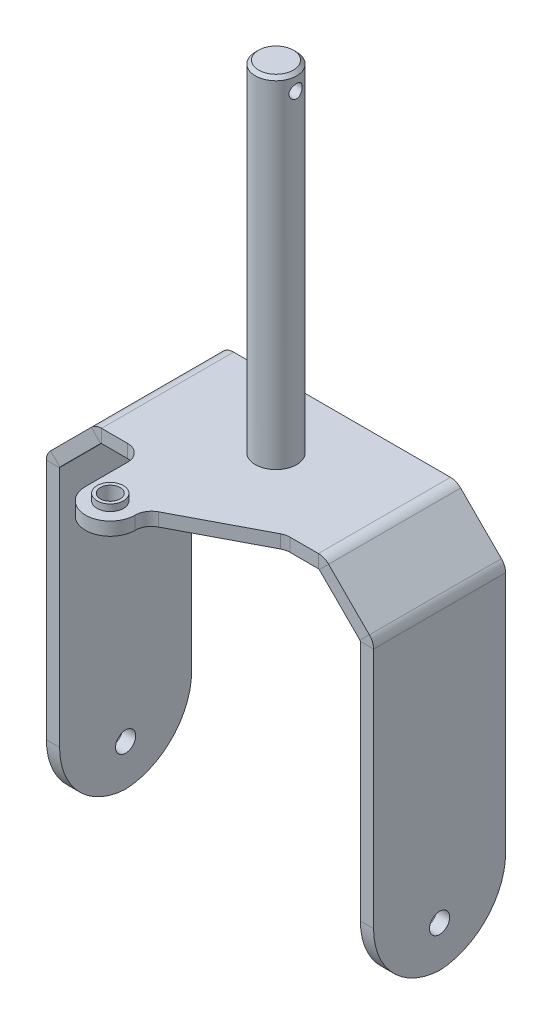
ISO-10303-21;
HEADER;
FILE_DESCRIPTION(('STEP AP214'),'2;1');
FILE_NAME('part.step','',(''),(''),'','','');
FILE_SCHEMA(('AUTOMOTIVE_DESIGN { 1 0 10303 214 1 1 1 1 }'));
ENDSEC;
DATA;
#1=APPLICATION_CONTEXT('core data for automotive mechanical design processes');
#2=APPLICATION_PROTOCOL_DEFINITION('international standard','automotive_design',2000,#1);
#3=PRODUCT_CONTEXT('',#1,'mechanical');
#4=PRODUCT('Part','Part','',(#3));
#5=PRODUCT_RELATED_PRODUCT_CATEGORY('part','',(#4));
#6=PRODUCT_DEFINITION_FORMATION('','',#4);
#7=PRODUCT_DEFINITION_CONTEXT('part definition',#1,'design');
#8=PRODUCT_DEFINITION('design','',#6,#7);
#9=PRODUCT_DEFINITION_SHAPE('','',#8);
#10=(LENGTH_UNIT() NAMED_UNIT(*) SI_UNIT(.MILLI.,.METRE.));
#11=(NAMED_UNIT(*) PLANE_ANGLE_UNIT() SI_UNIT($,.RADIAN.));
#12=(NAMED_UNIT(*) SI_UNIT($,.STERADIAN.) SOLID_ANGLE_UNIT());
#13=UNCERTAINTY_MEASURE_WITH_UNIT(LENGTH_MEASURE(1.E-05),#10,'distance_accuracy_value','');
#14=(GEOMETRIC_REPRESENTATION_CONTEXT(3) GLOBAL_UNCERTAINTY_ASSIGNED_CONTEXT((#13)) GLOBAL_UNIT_ASSIGNED_CONTEXT((#10,
#11,#12)) REPRESENTATION_CONTEXT('',''));
#15=CARTESIAN_POINT('',(0.,0.,0.));
#16=DIRECTION('',(0.,0.,1.));
#17=DIRECTION('',(1.,0.,0.));
#18=AXIS2_PLACEMENT_3D('',#15,#16,#17);
#19=CARTESIAN_POINT('',(-50.,8.,50.));
#20=DIRECTION('',(0.,1.,0.));
#21=DIRECTION('',(0.,0.,1.));
#22=AXIS2_PLACEMENT_3D('',#19,#20,#21);
#23=PLANE('',#22);
#24=DIRECTION('',(1.,0.,0.));
#25=VECTOR('',#24,1.);
#26=CARTESIAN_POINT('',(48.4617992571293,8.,40.));
#27=LINE('',#26,#25);
#28=CARTESIAN_POINT('',(48.4617992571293,8.,40.));
#29=VERTEX_POINT('',#28);
#30=CARTESIAN_POINT('',(65.6948902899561,7.99999999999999,40.));
#31=VERTEX_POINT('',#30);
#32=EDGE_CURVE('E476',#29,#31,#27,.T.);
#33=ORIENTED_EDGE('',*,*,#32,.T.);
#34=DIRECTION('',(0.,0.,1.));
#35=VECTOR('',#34,1.);
#36=CARTESIAN_POINT('',(65.6948902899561,7.99999999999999,40.));
#37=LINE('',#36,#35);
#38=CARTESIAN_POINT('',(65.694890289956,8.,-40.));
#39=VERTEX_POINT('',#38);
#40=EDGE_CURVE('E377',#31,#39,#37,.F.);
#41=ORIENTED_EDGE('',*,*,#40,.T.);
#42=DIRECTION('',(-1.,0.,0.));
#43=VECTOR('',#42,1.);
#44=CARTESIAN_POINT('',(-66.,8.,-40.));
#45=LINE('',#44,#43);
#46=CARTESIAN_POINT('',(-65.6948902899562,7.99999999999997,-40.));
#47=VERTEX_POINT('',#46);
#48=EDGE_CURVE('E479',#39,#47,#45,.T.);
#49=ORIENTED_EDGE('',*,*,#48,.T.);
#50=DIRECTION('',(0.,0.,-1.));
#51=VECTOR('',#50,1.);
#52=CARTESIAN_POINT('',(-65.6948902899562,7.99999999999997,-40.));
#53=LINE('',#52,#51);
#54=CARTESIAN_POINT('',(-65.694890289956,8.,40.));
#55=VERTEX_POINT('',#54);
#56=EDGE_CURVE('E422',#47,#55,#53,.F.);
#57=ORIENTED_EDGE('',*,*,#56,.T.);
#58=DIRECTION('',(1.,0.,0.));
#59=VECTOR('',#58,1.);
#60=CARTESIAN_POINT('',(-66.,8.,40.));
#61=LINE('',#60,#59);
#62=CARTESIAN_POINT('',(-50.,8.,40.));
#63=VERTEX_POINT('',#62);
#64=EDGE_CURVE('E462',#55,#63,#61,.T.);
#65=ORIENTED_EDGE('',*,*,#64,.T.);
#66=CARTESIAN_POINT('',(-50.,8.,50.));
#67=DIRECTION('',(0.,-1.,0.));
#68=DIRECTION('',(0.,0.,1.));
#69=AXIS2_PLACEMENT_3D('',#66,#67,#68);
#70=CIRCLE('',#69,10.);
#71=CARTESIAN_POINT('',(-40.,8.,50.));
#72=VERTEX_POINT('',#71);
#73=EDGE_CURVE('E464',#63,#72,#70,.T.);
#74=ORIENTED_EDGE('',*,*,#73,.T.);
#75=DIRECTION('',(0.,0.,1.));
#76=VECTOR('',#75,1.);
#77=CARTESIAN_POINT('',(-40.,8.,50.));
#78=LINE('',#77,#76);
#79=CARTESIAN_POINT('',(-40.,8.,75.4));
#80=VERTEX_POINT('',#79);
#81=EDGE_CURVE('E466',#72,#80,#78,.T.);
#82=ORIENTED_EDGE('',*,*,#81,.T.);
#83=CARTESIAN_POINT('',(-25.,8.,75.4));
#84=DIRECTION('',(0.,1.,0.));
#85=DIRECTION('',(0.,0.,1.));
#86=AXIS2_PLACEMENT_3D('',#83,#84,#85);
#87=CIRCLE('',#86,15.);
#88=CARTESIAN_POINT('',(-10.,8.,75.4));
#89=VERTEX_POINT('',#88);
#90=EDGE_CURVE('E468',#80,#89,#87,.T.);
#91=ORIENTED_EDGE('',*,*,#90,.T.);
#92=CARTESIAN_POINT('',(0.,8.,75.4));
#93=DIRECTION('',(0.,-1.,0.));
#94=DIRECTION('',(0.,0.,1.));
#95=AXIS2_PLACEMENT_3D('',#92,#93,#94);
#96=CIRCLE('',#95,10.);
#97=CARTESIAN_POINT('',(-4.64225661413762,8.,66.5428303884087));
#98=VERTEX_POINT('',#97);
#99=EDGE_CURVE('E470',#89,#98,#96,.T.);
#100=ORIENTED_EDGE('',*,*,#99,.T.);
#101=DIRECTION('',(0.885716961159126,0.,-0.464225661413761));
#102=VECTOR('',#101,1.);
#103=CARTESIAN_POINT('',(-4.64225661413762,8.,66.5428303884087));
#104=LINE('',#103,#102);
#105=CARTESIAN_POINT('',(43.8195426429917,8.,41.1428303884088));
#106=VERTEX_POINT('',#105);
#107=EDGE_CURVE('E472',#98,#106,#104,.T.);
#108=ORIENTED_EDGE('',*,*,#107,.T.);
#109=CARTESIAN_POINT('',(48.4617992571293,8.,50.));
#110=DIRECTION('',(0.,-1.,0.));
#111=DIRECTION('',(0.,0.,1.));
#112=AXIS2_PLACEMENT_3D('',#109,#110,#111);
#113=CIRCLE('',#112,9.99999999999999);
#114=EDGE_CURVE('E474',#106,#29,#113,.T.);
#115=ORIENTED_EDGE('',*,*,#114,.T.);
#116=EDGE_LOOP('',(#33,#41,#49,#57,#65,#74,#82,#91,#100,#108,#115));
#117=FACE_BOUND('',#116,.T.);
#118=CARTESIAN_POINT('',(0.,8.,0.));
#119=DIRECTION('',(0.,1.,0.));
#120=DIRECTION('',(0.,0.,1.));
#121=AXIS2_PLACEMENT_3D('',#118,#119,#120);
#122=CIRCLE('',#121,12.5);
#123=CARTESIAN_POINT('',(0.,8.,12.5));
#124=VERTEX_POINT('',#123);
#125=EDGE_CURVE('E439',#124,#124,#122,.T.);
#126=ORIENTED_EDGE('',*,*,#125,.F.);
#127=EDGE_LOOP('',(#126));
#128=FACE_BOUND('',#127,.T.);
#129=CARTESIAN_POINT('',(-25.,8.,75.4));
#130=DIRECTION('',(0.,1.,0.));
#131=DIRECTION('',(0.,0.,1.));
#132=AXIS2_PLACEMENT_3D('',#129,#130,#131);
#133=CIRCLE('',#132,8.);
#134=CARTESIAN_POINT('',(-25.,8.,83.4));
#135=VERTEX_POINT('',#134);
#136=EDGE_CURVE('E838',#135,#135,#133,.T.);
#137=ORIENTED_EDGE('',*,*,#136,.F.);
#138=EDGE_LOOP('',(#137));
#139=FACE_BOUND('',#138,.T.);
#140=ADVANCED_FACE('F32',(#117,#128,#139),#23,.T.);
#141=CARTESIAN_POINT('',(99.1022907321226,-25.1022907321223,40.));
#142=DIRECTION('',(1.,0.,0.));
#143=DIRECTION('',(0.,1.,0.));
#144=AXIS2_PLACEMENT_3D('',#141,#142,#143);
#145=PLANE('',#144);
#146=CARTESIAN_POINT('',(99.1022907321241,-189.054644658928,0.));
#147=DIRECTION('',(1.,0.,0.));
#148=DIRECTION('',(0.,1.,0.));
#149=AXIS2_PLACEMENT_3D('',#146,#147,#148);
#150=CIRCLE('',#149,6.1);
#151=CARTESIAN_POINT('',(99.1022907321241,-182.954644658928,0.));
#152=VERTEX_POINT('',#151);
#153=EDGE_CURVE('E737',#152,#152,#150,.T.);
#154=ORIENTED_EDGE('',*,*,#153,.F.);
#155=EDGE_LOOP('',(#154));
#156=FACE_BOUND('',#155,.T.);
#157=CARTESIAN_POINT('',(99.102290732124,-172.102290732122,-2.));
#158=DIRECTION('',(1.,0.,0.));
#159=DIRECTION('',(0.,1.,0.));
#160=AXIS2_PLACEMENT_3D('',#157,#158,#159);
#161=CIRCLE('',#160,42.);
#162=CARTESIAN_POINT('',(99.1022907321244,-214.054644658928,3.00107161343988E-13));
#163=VERTEX_POINT('',#162);
#164=CARTESIAN_POINT('',(99.102290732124,-172.102290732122,40.));
#165=VERTEX_POINT('',#164);
#166=EDGE_CURVE('E250',#163,#165,#161,.F.);
#167=ORIENTED_EDGE('',*,*,#166,.F.);
#168=CARTESIAN_POINT('',(99.102290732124,-172.102290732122,2.));
#169=DIRECTION('',(1.,0.,0.));
#170=DIRECTION('',(0.,1.,0.));
#171=AXIS2_PLACEMENT_3D('',#168,#169,#170);
#172=CIRCLE('',#171,42.);
#173=CARTESIAN_POINT('',(99.102290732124,-172.102290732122,-40.));
#174=VERTEX_POINT('',#173);
#175=EDGE_CURVE('E53',#163,#174,#172,.T.);
#176=ORIENTED_EDGE('',*,*,#175,.T.);
#177=DIRECTION('',(0.,-1.,0.));
#178=VECTOR('',#177,1.);
#179=CARTESIAN_POINT('',(99.1022907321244,-214.102290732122,-40.));
#180=LINE('',#179,#178);
#181=CARTESIAN_POINT('',(99.1022907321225,-25.4074004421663,-40.));
#182=VERTEX_POINT('',#181);
#183=EDGE_CURVE('E274',#182,#174,#180,.T.);
#184=ORIENTED_EDGE('',*,*,#183,.F.);
#185=DIRECTION('',(0.,0.,1.));
#186=VECTOR('',#185,1.);
#187=CARTESIAN_POINT('',(99.1022907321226,-25.4074004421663,40.));
#188=LINE('',#187,#186);
#189=CARTESIAN_POINT('',(99.1022907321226,-25.4074004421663,40.));
#190=VERTEX_POINT('',#189);
#191=EDGE_CURVE('E266',#182,#190,#188,.T.);
#192=ORIENTED_EDGE('',*,*,#191,.T.);
#193=DIRECTION('',(0.,1.,0.));
#194=VECTOR('',#193,1.);
#195=CARTESIAN_POINT('',(99.1022907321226,-25.1022907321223,40.));
#196=LINE('',#195,#194);
#197=EDGE_CURVE('E277',#165,#190,#196,.T.);
#198=ORIENTED_EDGE('',*,*,#197,.F.);
#199=EDGE_LOOP('',(#167,#176,#184,#192,#198));
#200=FACE_BOUND('',#199,.T.);
#201=ADVANCED_FACE('F539',(#156,#200),#145,.T.);
#202=CARTESIAN_POINT('',(91.1022907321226,-25.1022907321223,40.));
#203=DIRECTION('',(1.,0.,0.));
#204=DIRECTION('',(0.,1.,0.));
#205=AXIS2_PLACEMENT_3D('',#202,#203,#204);
#206=PLANE('',#205);
#207=CARTESIAN_POINT('',(91.1022907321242,-189.054644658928,0.));
#208=DIRECTION('',(1.,0.,0.));
#209=DIRECTION('',(0.,1.,0.));
#210=AXIS2_PLACEMENT_3D('',#207,#208,#209);
#211=CIRCLE('',#210,6.1);
#212=CARTESIAN_POINT('',(91.1022907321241,-182.954644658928,0.));
#213=VERTEX_POINT('',#212);
#214=EDGE_CURVE('E244',#213,#213,#211,.T.);
#215=ORIENTED_EDGE('',*,*,#214,.T.);
#216=EDGE_LOOP('',(#215));
#217=FACE_BOUND('',#216,.T.);
#218=CARTESIAN_POINT('',(91.102290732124,-172.102290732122,2.));
#219=DIRECTION('',(1.,0.,0.));
#220=DIRECTION('',(0.,1.,0.));
#221=AXIS2_PLACEMENT_3D('',#218,#219,#220);
#222=CIRCLE('',#221,42.);
#223=CARTESIAN_POINT('',(91.1022907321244,-214.054644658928,2.97071395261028E-13));
#224=VERTEX_POINT('',#223);
#225=CARTESIAN_POINT('',(91.1022907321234,-172.102290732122,-40.));
#226=VERTEX_POINT('',#225);
#227=EDGE_CURVE('E229',#224,#226,#222,.T.);
#228=ORIENTED_EDGE('',*,*,#227,.F.);
#229=CARTESIAN_POINT('',(91.102290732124,-172.102290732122,-2.));
#230=DIRECTION('',(1.,0.,0.));
#231=DIRECTION('',(0.,1.,0.));
#232=AXIS2_PLACEMENT_3D('',#229,#230,#231);
#233=CIRCLE('',#232,42.);
#234=CARTESIAN_POINT('',(91.1022907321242,-172.102290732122,40.));
#235=VERTEX_POINT('',#234);
#236=EDGE_CURVE('E239',#224,#235,#233,.F.);
#237=ORIENTED_EDGE('',*,*,#236,.T.);
#238=DIRECTION('',(0.,1.,0.));
#239=VECTOR('',#238,1.);
#240=CARTESIAN_POINT('',(91.1022907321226,-25.1022907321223,40.));
#241=LINE('',#240,#239);
#242=CARTESIAN_POINT('',(91.1022907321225,-25.4074004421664,40.));
#243=VERTEX_POINT('',#242);
#244=EDGE_CURVE('E272',#235,#243,#241,.T.);
#245=ORIENTED_EDGE('',*,*,#244,.T.);
#246=DIRECTION('',(0.,0.,1.));
#247=VECTOR('',#246,1.);
#248=CARTESIAN_POINT('',(91.1022907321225,-25.4074004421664,-40.));
#249=LINE('',#248,#247);
#250=CARTESIAN_POINT('',(91.1022907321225,-25.4074004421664,-40.));
#251=VERTEX_POINT('',#250);
#252=EDGE_CURVE('E260',#251,#243,#249,.T.);
#253=ORIENTED_EDGE('',*,*,#252,.F.);
#254=DIRECTION('',(0.,-1.,0.));
#255=VECTOR('',#254,1.);
#256=CARTESIAN_POINT('',(91.1022907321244,-214.102290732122,-40.));
#257=LINE('',#256,#255);
#258=EDGE_CURVE('E243',#251,#226,#257,.T.);
#259=ORIENTED_EDGE('',*,*,#258,.T.);
#260=EDGE_LOOP('',(#228,#237,#245,#253,#259));
#261=FACE_BOUND('',#260,.T.);
#262=ADVANCED_FACE('F238',(#217,#261),#206,.F.);
#263=CARTESIAN_POINT('',(91.102290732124,-172.102290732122,-2.));
#264=DIRECTION('',(1.,0.,0.));
#265=DIRECTION('',(0.,1.,0.));
#266=AXIS2_PLACEMENT_3D('',#263,#264,#265);
#267=CYLINDRICAL_SURFACE('',#266,42.);
#268=ORIENTED_EDGE('',*,*,#236,.F.);
#269=DIRECTION('',(-1.,0.,0.));
#270=VECTOR('',#269,1.);
#271=CARTESIAN_POINT('',(91.1022907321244,-214.054644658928,2.97071395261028E-13));
#272=LINE('',#271,#270);
#273=EDGE_CURVE('E226',#224,#163,#272,.F.);
#274=ORIENTED_EDGE('',*,*,#273,.T.);
#275=ORIENTED_EDGE('',*,*,#166,.T.);
#276=DIRECTION('',(-1.,0.,0.));
#277=VECTOR('',#276,1.);
#278=CARTESIAN_POINT('',(91.1022907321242,-172.102290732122,40.));
#279=LINE('',#278,#277);
#280=EDGE_CURVE('E248',#235,#165,#279,.F.);
#281=ORIENTED_EDGE('',*,*,#280,.F.);
#282=EDGE_LOOP('',(#268,#274,#275,#281));
#283=FACE_BOUND('',#282,.T.);
#284=ADVANCED_FACE('F246',(#283),#267,.T.);
#285=CARTESIAN_POINT('',(-99.1022907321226,-25.1022907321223,-40.));
#286=DIRECTION('',(-1.,0.,0.));
#287=DIRECTION('',(0.,-1.,0.));
#288=AXIS2_PLACEMENT_3D('',#285,#286,#287);
#289=PLANE('',#288);
#290=CARTESIAN_POINT('',(-99.1022907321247,-189.05464465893,1.29683751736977E-13));
#291=DIRECTION('',(1.,0.,0.));
#292=DIRECTION('',(0.,1.,0.));
#293=AXIS2_PLACEMENT_3D('',#290,#291,#292);
#294=CIRCLE('',#293,6.1);
#295=CARTESIAN_POINT('',(-99.1022907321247,-182.95464465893,1.29683751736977E-13));
#296=VERTEX_POINT('',#295);
#297=EDGE_CURVE('E506',#296,#296,#294,.T.);
#298=ORIENTED_EDGE('',*,*,#297,.T.);
#299=EDGE_LOOP('',(#298));
#300=FACE_BOUND('',#299,.T.);
#301=DIRECTION('',(0.,1.,0.));
#302=VECTOR('',#301,1.);
#303=CARTESIAN_POINT('',(-99.1022907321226,-25.1022907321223,-40.));
#304=LINE('',#303,#302);
#305=CARTESIAN_POINT('',(-99.102290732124,-172.102290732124,-40.0000000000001));
#306=VERTEX_POINT('',#305);
#307=CARTESIAN_POINT('',(-99.1022907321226,-25.4074004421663,-40.));
#308=VERTEX_POINT('',#307);
#309=EDGE_CURVE('E322',#306,#308,#304,.T.);
#310=ORIENTED_EDGE('',*,*,#309,.F.);
#311=CARTESIAN_POINT('',(-99.102290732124,-172.102290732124,1.99999999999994));
#312=DIRECTION('',(-1.,0.,0.));
#313=DIRECTION('',(0.,-1.,0.));
#314=AXIS2_PLACEMENT_3D('',#311,#312,#313);
#315=CIRCLE('',#314,42.);
#316=CARTESIAN_POINT('',(-99.1022907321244,-214.054644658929,1.86656246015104E-11));
#317=VERTEX_POINT('',#316);
#318=EDGE_CURVE('E747',#306,#317,#315,.T.);
#319=ORIENTED_EDGE('',*,*,#318,.T.);
#320=CARTESIAN_POINT('',(-99.102290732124,-172.102290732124,-1.99999999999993));
#321=DIRECTION('',(-1.,0.,0.));
#322=DIRECTION('',(0.,-1.,0.));
#323=AXIS2_PLACEMENT_3D('',#320,#321,#322);
#324=CIRCLE('',#323,42.);
#325=CARTESIAN_POINT('',(-99.102290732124,-172.102290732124,40.0000000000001));
#326=VERTEX_POINT('',#325);
#327=EDGE_CURVE('E254',#326,#317,#324,.F.);
#328=ORIENTED_EDGE('',*,*,#327,.F.);
#329=DIRECTION('',(0.,-1.,0.));
#330=VECTOR('',#329,1.);
#331=CARTESIAN_POINT('',(-99.1022907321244,-214.102290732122,40.));
#332=LINE('',#331,#330);
#333=CARTESIAN_POINT('',(-99.1022907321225,-25.4074004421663,40.));
#334=VERTEX_POINT('',#333);
#335=EDGE_CURVE('E319',#334,#326,#332,.T.);
#336=ORIENTED_EDGE('',*,*,#335,.F.);
#337=DIRECTION('',(0.,0.,-1.));
#338=VECTOR('',#337,1.);
#339=CARTESIAN_POINT('',(-99.1022907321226,-25.4074004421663,-40.));
#340=LINE('',#339,#338);
#341=EDGE_CURVE('E309',#334,#308,#340,.T.);
#342=ORIENTED_EDGE('',*,*,#341,.T.);
#343=EDGE_LOOP('',(#310,#319,#328,#336,#342));
#344=FACE_BOUND('',#343,.T.);
#345=ADVANCED_FACE('F719',(#300,#344),#289,.T.);
#346=CARTESIAN_POINT('',(-91.1022907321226,-25.1022907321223,-40.));
#347=DIRECTION('',(-1.,0.,0.));
#348=DIRECTION('',(0.,-1.,0.));
#349=AXIS2_PLACEMENT_3D('',#346,#347,#348);
#350=PLANE('',#349);
#351=CARTESIAN_POINT('',(-91.1022907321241,-189.05464465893,1.26908194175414E-13));
#352=DIRECTION('',(-1.,0.,0.));
#353=DIRECTION('',(0.,-1.,0.));
#354=AXIS2_PLACEMENT_3D('',#351,#352,#353);
#355=CIRCLE('',#354,6.1);
#356=CARTESIAN_POINT('',(-91.1022907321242,-195.15464465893,1.26908194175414E-13));
#357=VERTEX_POINT('',#356);
#358=EDGE_CURVE('E503',#357,#357,#355,.T.);
#359=ORIENTED_EDGE('',*,*,#358,.T.);
#360=EDGE_LOOP('',(#359));
#361=FACE_BOUND('',#360,.T.);
#362=CARTESIAN_POINT('',(-91.102290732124,-172.102290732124,1.99999999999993));
#363=DIRECTION('',(-1.,0.,0.));
#364=DIRECTION('',(0.,-1.,0.));
#365=AXIS2_PLACEMENT_3D('',#362,#363,#364);
#366=CIRCLE('',#365,42.);
#367=CARTESIAN_POINT('',(-91.1022907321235,-172.102290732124,-40.0000000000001));
#368=VERTEX_POINT('',#367);
#369=CARTESIAN_POINT('',(-91.1022907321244,-214.05464465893,0.));
#370=VERTEX_POINT('',#369);
#371=EDGE_CURVE('E61',#368,#370,#366,.T.);
#372=ORIENTED_EDGE('',*,*,#371,.F.);
#373=DIRECTION('',(0.,1.,0.));
#374=VECTOR('',#373,1.);
#375=CARTESIAN_POINT('',(-91.1022907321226,-25.1022907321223,-40.));
#376=LINE('',#375,#374);
#377=CARTESIAN_POINT('',(-91.1022907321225,-25.4074004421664,-40.));
#378=VERTEX_POINT('',#377);
#379=EDGE_CURVE('E317',#368,#378,#376,.T.);
#380=ORIENTED_EDGE('',*,*,#379,.T.);
#381=DIRECTION('',(0.,0.,-1.));
#382=VECTOR('',#381,1.);
#383=CARTESIAN_POINT('',(-91.1022907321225,-25.4074004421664,40.));
#384=LINE('',#383,#382);
#385=CARTESIAN_POINT('',(-91.1022907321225,-25.4074004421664,40.));
#386=VERTEX_POINT('',#385);
#387=EDGE_CURVE('E303',#386,#378,#384,.T.);
#388=ORIENTED_EDGE('',*,*,#387,.F.);
#389=DIRECTION('',(0.,-1.,0.));
#390=VECTOR('',#389,1.);
#391=CARTESIAN_POINT('',(-91.1022907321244,-214.102290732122,40.));
#392=LINE('',#391,#390);
#393=CARTESIAN_POINT('',(-91.1022907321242,-172.102290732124,40.0000000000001));
#394=VERTEX_POINT('',#393);
#395=EDGE_CURVE('E314',#386,#394,#392,.T.);
#396=ORIENTED_EDGE('',*,*,#395,.T.);
#397=CARTESIAN_POINT('',(-91.102290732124,-172.102290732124,-1.99999999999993));
#398=DIRECTION('',(-1.,0.,0.));
#399=DIRECTION('',(0.,-1.,0.));
#400=AXIS2_PLACEMENT_3D('',#397,#398,#399);
#401=CIRCLE('',#400,42.);
#402=EDGE_CURVE('E753',#394,#370,#401,.F.);
#403=ORIENTED_EDGE('',*,*,#402,.T.);
#404=EDGE_LOOP('',(#372,#380,#388,#396,#403));
#405=FACE_BOUND('',#404,.T.);
#406=ADVANCED_FACE('F772',(#361,#405),#350,.F.);
#407=CARTESIAN_POINT('',(-99.1022907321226,-25.1022907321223,-40.));
#408=DIRECTION('',(0.,0.,-1.));
#409=DIRECTION('',(-1.,0.,0.));
#410=AXIS2_PLACEMENT_3D('',#407,#408,#409);
#411=PLANE('',#410);
#412=ORIENTED_EDGE('',*,*,#379,.F.);
#413=DIRECTION('',(1.,0.,0.));
#414=VECTOR('',#413,1.);
#415=CARTESIAN_POINT('',(-91.1022907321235,-172.102290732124,-40.0000000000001));
#416=LINE('',#415,#414);
#417=EDGE_CURVE('E750',#368,#306,#416,.F.);
#418=ORIENTED_EDGE('',*,*,#417,.T.);
#419=ORIENTED_EDGE('',*,*,#309,.T.);
#420=DIRECTION('',(-1.,0.,0.));
#421=VECTOR('',#420,1.);
#422=CARTESIAN_POINT('',(-91.1022907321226,-25.4074004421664,-40.));
#423=LINE('',#422,#421);
#424=EDGE_CURVE('E306',#378,#308,#423,.T.);
#425=ORIENTED_EDGE('',*,*,#424,.F.);
#426=EDGE_LOOP('',(#412,#418,#419,#425));
#427=FACE_BOUND('',#426,.T.);
#428=ADVANCED_FACE('F722',(#427),#411,.T.);
#429=CARTESIAN_POINT('',(-91.102290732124,-172.102290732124,-1.99999999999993));
#430=DIRECTION('',(-1.,0.,0.));
#431=DIRECTION('',(0.,-1.,0.));
#432=AXIS2_PLACEMENT_3D('',#429,#430,#431);
#433=CYLINDRICAL_SURFACE('',#432,42.);
#434=ORIENTED_EDGE('',*,*,#327,.T.);
#435=DIRECTION('',(1.,0.,0.));
#436=VECTOR('',#435,1.);
#437=CARTESIAN_POINT('',(-91.1022907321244,-214.054644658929,1.86656246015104E-11));
#438=LINE('',#437,#436);
#439=EDGE_CURVE('E751',#370,#317,#438,.F.);
#440=ORIENTED_EDGE('',*,*,#439,.F.);
#441=ORIENTED_EDGE('',*,*,#402,.F.);
#442=DIRECTION('',(1.,0.,0.));
#443=VECTOR('',#442,1.);
#444=CARTESIAN_POINT('',(-91.1022907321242,-172.102290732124,40.0000000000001));
#445=LINE('',#444,#443);
#446=EDGE_CURVE('E251',#394,#326,#445,.F.);
#447=ORIENTED_EDGE('',*,*,#446,.T.);
#448=EDGE_LOOP('',(#434,#440,#441,#447));
#449=FACE_BOUND('',#448,.T.);
#450=ADVANCED_FACE('F712',(#449),#433,.T.);
#451=CARTESIAN_POINT('',(99.1022907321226,-25.1022907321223,40.));
#452=DIRECTION('',(0.,0.,1.));
#453=DIRECTION('',(1.,0.,0.));
#454=AXIS2_PLACEMENT_3D('',#451,#452,#453);
#455=PLANE('',#454);
#456=ORIENTED_EDGE('',*,*,#244,.F.);
#457=ORIENTED_EDGE('',*,*,#280,.T.);
#458=ORIENTED_EDGE('',*,*,#197,.T.);
#459=DIRECTION('',(1.,0.,0.));
#460=VECTOR('',#459,1.);
#461=CARTESIAN_POINT('',(91.1022907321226,-25.4074004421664,40.));
#462=LINE('',#461,#460);
#463=EDGE_CURVE('E263',#243,#190,#462,.T.);
#464=ORIENTED_EDGE('',*,*,#463,.F.);
#465=EDGE_LOOP('',(#456,#457,#458,#464));
#466=FACE_BOUND('',#465,.T.);
#467=ADVANCED_FACE('F690',(#466),#455,.T.);
#468=CARTESIAN_POINT('',(96.7591449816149,-19.4454364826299,40.));
#469=DIRECTION('',(0.,0.,1.));
#470=DIRECTION('',(0.,-1.,0.));
#471=AXIS2_PLACEMENT_3D('',#468,#469,#470);
#472=PLANE('',#471);
#473=DIRECTION('',(-0.707106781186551,0.707106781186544,0.));
#474=VECTOR('',#473,1.);
#475=CARTESIAN_POINT('',(91.1022907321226,-25.1022907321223,40.));
#476=LINE('',#475,#474);
#477=CARTESIAN_POINT('',(90.8865455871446,-24.8865455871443,40.));
#478=VERTEX_POINT('',#477);
#479=CARTESIAN_POINT('',(66.215745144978,-0.215745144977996,40.));
#480=VERTEX_POINT('',#479);
#481=EDGE_CURVE('E361',#478,#480,#476,.T.);
#482=ORIENTED_EDGE('',*,*,#481,.F.);
#483=DIRECTION('',(0.707106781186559,0.707106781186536,0.));
#484=VECTOR('',#483,1.);
#485=CARTESIAN_POINT('',(90.8865455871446,-24.8865455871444,40.));
#486=LINE('',#485,#484);
#487=CARTESIAN_POINT('',(96.543399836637,-19.2296913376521,40.));
#488=VERTEX_POINT('',#487);
#489=EDGE_CURVE('E294',#478,#488,#486,.T.);
#490=ORIENTED_EDGE('',*,*,#489,.T.);
#491=DIRECTION('',(-0.707106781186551,0.707106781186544,0.));
#492=VECTOR('',#491,1.);
#493=CARTESIAN_POINT('',(96.7591449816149,-19.4454364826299,40.));
#494=LINE('',#493,#492);
#495=CARTESIAN_POINT('',(71.8725993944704,5.44110910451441,40.));
#496=VERTEX_POINT('',#495);
#497=EDGE_CURVE('E366',#488,#496,#494,.T.);
#498=ORIENTED_EDGE('',*,*,#497,.T.);
#499=DIRECTION('',(0.707106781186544,0.707106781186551,0.));
#500=VECTOR('',#499,1.);
#501=CARTESIAN_POINT('',(66.215745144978,-0.215745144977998,40.));
#502=LINE('',#501,#500);
#503=EDGE_CURVE('E351',#480,#496,#502,.T.);
#504=ORIENTED_EDGE('',*,*,#503,.F.);
#505=EDGE_LOOP('',(#482,#490,#498,#504));
#506=FACE_BOUND('',#505,.T.);
#507=ADVANCED_FACE('F664',(#506),#472,.T.);
#508=CARTESIAN_POINT('',(71.6568542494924,5.65685424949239,40.));
#509=DIRECTION('',(-0.707106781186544,-0.707106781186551,0.));
#510=DIRECTION('',(0.707106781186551,-0.707106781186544,0.));
#511=AXIS2_PLACEMENT_3D('',#508,#509,#510);
#512=PLANE('',#511);
#513=DIRECTION('',(0.,0.,1.));
#514=VECTOR('',#513,1.);
#515=CARTESIAN_POINT('',(96.543399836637,-19.2296913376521,40.));
#516=LINE('',#515,#514);
#517=CARTESIAN_POINT('',(96.5433998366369,-19.229691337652,-40.));
#518=VERTEX_POINT('',#517);
#519=EDGE_CURVE('E289',#488,#518,#516,.F.);
#520=ORIENTED_EDGE('',*,*,#519,.T.);
#521=DIRECTION('',(0.707106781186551,-0.707106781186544,0.));
#522=VECTOR('',#521,1.);
#523=CARTESIAN_POINT('',(71.6568542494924,5.6568542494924,-40.));
#524=LINE('',#523,#522);
#525=CARTESIAN_POINT('',(71.8725993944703,5.44110910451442,-40.));
#526=VERTEX_POINT('',#525);
#527=EDGE_CURVE('E363',#526,#518,#524,.T.);
#528=ORIENTED_EDGE('',*,*,#527,.F.);
#529=DIRECTION('',(0.,0.,-1.));
#530=VECTOR('',#529,1.);
#531=CARTESIAN_POINT('',(71.8725993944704,5.44110910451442,40.));
#532=LINE('',#531,#530);
#533=EDGE_CURVE('E354',#496,#526,#532,.T.);
#534=ORIENTED_EDGE('',*,*,#533,.F.);
#535=ORIENTED_EDGE('',*,*,#497,.F.);
#536=EDGE_LOOP('',(#520,#528,#534,#535));
#537=FACE_BOUND('',#536,.T.);
#538=ADVANCED_FACE('F668',(#537),#512,.F.);
#539=CARTESIAN_POINT('',(66.,0.,40.));
#540=DIRECTION('',(-0.707106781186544,-0.707106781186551,0.));
#541=DIRECTION('',(0.707106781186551,-0.707106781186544,0.));
#542=AXIS2_PLACEMENT_3D('',#539,#540,#541);
#543=PLANE('',#542);
#544=DIRECTION('',(0.707106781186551,-0.707106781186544,0.));
#545=VECTOR('',#544,1.);
#546=CARTESIAN_POINT('',(66.,0.,-40.));
#547=LINE('',#546,#545);
#548=CARTESIAN_POINT('',(66.215745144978,-0.215745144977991,-40.));
#549=VERTEX_POINT('',#548);
#550=CARTESIAN_POINT('',(90.8865455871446,-24.8865455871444,-40.));
#551=VERTEX_POINT('',#550);
#552=EDGE_CURVE('E358',#549,#551,#547,.T.);
#553=ORIENTED_EDGE('',*,*,#552,.T.);
#554=DIRECTION('',(0.,0.,1.));
#555=VECTOR('',#554,1.);
#556=CARTESIAN_POINT('',(90.8865455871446,-24.8865455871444,40.));
#557=LINE('',#556,#555);
#558=EDGE_CURVE('E284',#478,#551,#557,.F.);
#559=ORIENTED_EDGE('',*,*,#558,.F.);
#560=ORIENTED_EDGE('',*,*,#481,.T.);
#561=DIRECTION('',(0.,0.,1.));
#562=VECTOR('',#561,1.);
#563=CARTESIAN_POINT('',(66.215745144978,-0.215745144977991,-40.));
#564=LINE('',#563,#562);
#565=EDGE_CURVE('E348',#549,#480,#564,.T.);
#566=ORIENTED_EDGE('',*,*,#565,.F.);
#567=EDGE_LOOP('',(#553,#559,#560,#566));
#568=FACE_BOUND('',#567,.T.);
#569=ADVANCED_FACE('F793',(#568),#543,.T.);
#570=CARTESIAN_POINT('',(-71.6568542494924,5.6568542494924,-40.));
#571=DIRECTION('',(0.,0.,-1.));
#572=DIRECTION('',(-1.,0.,0.));
#573=AXIS2_PLACEMENT_3D('',#570,#571,#572);
#574=PLANE('',#573);
#575=DIRECTION('',(0.707106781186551,0.707106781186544,0.));
#576=VECTOR('',#575,1.);
#577=CARTESIAN_POINT('',(-66.,0.,-40.));
#578=LINE('',#577,#576);
#579=CARTESIAN_POINT('',(-90.8865455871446,-24.8865455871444,-40.));
#580=VERTEX_POINT('',#579);
#581=CARTESIAN_POINT('',(-66.215745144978,-0.215745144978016,-40.));
#582=VERTEX_POINT('',#581);
#583=EDGE_CURVE('E406',#580,#582,#578,.T.);
#584=ORIENTED_EDGE('',*,*,#583,.F.);
#585=DIRECTION('',(-0.707106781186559,0.707106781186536,0.));
#586=VECTOR('',#585,1.);
#587=CARTESIAN_POINT('',(-90.8865455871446,-24.8865455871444,-40.));
#588=LINE('',#587,#586);
#589=CARTESIAN_POINT('',(-96.543399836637,-19.2296913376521,-40.));
#590=VERTEX_POINT('',#589);
#591=EDGE_CURVE('E339',#580,#590,#588,.T.);
#592=ORIENTED_EDGE('',*,*,#591,.T.);
#593=DIRECTION('',(0.707106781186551,0.707106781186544,0.));
#594=VECTOR('',#593,1.);
#595=CARTESIAN_POINT('',(-71.6568542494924,5.6568542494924,-40.));
#596=LINE('',#595,#594);
#597=CARTESIAN_POINT('',(-71.8725993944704,5.44110910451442,-40.));
#598=VERTEX_POINT('',#597);
#599=EDGE_CURVE('E411',#590,#598,#596,.T.);
#600=ORIENTED_EDGE('',*,*,#599,.T.);
#601=DIRECTION('',(-0.707106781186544,0.707106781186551,0.));
#602=VECTOR('',#601,1.);
#603=CARTESIAN_POINT('',(-66.215745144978,-0.215745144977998,-40.));
#604=LINE('',#603,#602);
#605=EDGE_CURVE('E395',#582,#598,#604,.T.);
#606=ORIENTED_EDGE('',*,*,#605,.F.);
#607=EDGE_LOOP('',(#584,#592,#600,#606));
#608=FACE_BOUND('',#607,.T.);
#609=ADVANCED_FACE('F634',(#608),#574,.T.);
#610=CARTESIAN_POINT('',(-71.6568542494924,5.6568542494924,-40.));
#611=DIRECTION('',(-0.707106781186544,0.707106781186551,0.));
#612=DIRECTION('',(-0.707106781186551,-0.707106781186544,0.));
#613=AXIS2_PLACEMENT_3D('',#610,#611,#612);
#614=PLANE('',#613);
#615=ORIENTED_EDGE('',*,*,#599,.F.);
#616=DIRECTION('',(0.,0.,-1.));
#617=VECTOR('',#616,1.);
#618=CARTESIAN_POINT('',(-96.543399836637,-19.2296913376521,-40.));
#619=LINE('',#618,#617);
#620=CARTESIAN_POINT('',(-96.5433998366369,-19.229691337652,40.));
#621=VERTEX_POINT('',#620);
#622=EDGE_CURVE('E333',#590,#621,#619,.F.);
#623=ORIENTED_EDGE('',*,*,#622,.T.);
#624=DIRECTION('',(-0.70710678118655,-0.707106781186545,0.));
#625=VECTOR('',#624,1.);
#626=CARTESIAN_POINT('',(-96.7591449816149,-19.4454364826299,40.));
#627=LINE('',#626,#625);
#628=CARTESIAN_POINT('',(-71.8725993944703,5.44110910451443,40.));
#629=VERTEX_POINT('',#628);
#630=EDGE_CURVE('E408',#629,#621,#627,.T.);
#631=ORIENTED_EDGE('',*,*,#630,.F.);
#632=DIRECTION('',(0.,0.,-1.));
#633=VECTOR('',#632,1.);
#634=CARTESIAN_POINT('',(-71.8725993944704,5.4411091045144,-40.));
#635=LINE('',#634,#633);
#636=EDGE_CURVE('E398',#629,#598,#635,.T.);
#637=ORIENTED_EDGE('',*,*,#636,.T.);
#638=EDGE_LOOP('',(#615,#623,#631,#637));
#639=FACE_BOUND('',#638,.T.);
#640=ADVANCED_FACE('F624',(#639),#614,.T.);
#641=CARTESIAN_POINT('',(-66.,0.,-40.));
#642=DIRECTION('',(-0.707106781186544,0.707106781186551,0.));
#643=DIRECTION('',(-0.707106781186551,-0.707106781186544,0.));
#644=AXIS2_PLACEMENT_3D('',#641,#642,#643);
#645=PLANE('',#644);
#646=DIRECTION('',(0.,0.,-1.));
#647=VECTOR('',#646,1.);
#648=CARTESIAN_POINT('',(-90.8865455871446,-24.8865455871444,-40.));
#649=LINE('',#648,#647);
#650=CARTESIAN_POINT('',(-90.8865455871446,-24.8865455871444,40.));
#651=VERTEX_POINT('',#650);
#652=EDGE_CURVE('E329',#580,#651,#649,.F.);
#653=ORIENTED_EDGE('',*,*,#652,.F.);
#654=ORIENTED_EDGE('',*,*,#583,.T.);
#655=DIRECTION('',(0.,0.,-1.));
#656=VECTOR('',#655,1.);
#657=CARTESIAN_POINT('',(-66.215745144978,-0.215745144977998,40.));
#658=LINE('',#657,#656);
#659=CARTESIAN_POINT('',(-66.215745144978,-0.215745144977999,40.));
#660=VERTEX_POINT('',#659);
#661=EDGE_CURVE('E392',#660,#582,#658,.T.);
#662=ORIENTED_EDGE('',*,*,#661,.F.);
#663=DIRECTION('',(-0.70710678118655,-0.707106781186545,0.));
#664=VECTOR('',#663,1.);
#665=CARTESIAN_POINT('',(-91.1022907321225,-25.1022907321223,40.));
#666=LINE('',#665,#664);
#667=EDGE_CURVE('E403',#660,#651,#666,.T.);
#668=ORIENTED_EDGE('',*,*,#667,.T.);
#669=EDGE_LOOP('',(#653,#654,#662,#668));
#670=FACE_BOUND('',#669,.T.);
#671=ADVANCED_FACE('F639',(#670),#645,.F.);
#672=CARTESIAN_POINT('',(-50.,0.,50.));
#673=DIRECTION('',(0.,1.,0.));
#674=DIRECTION('',(0.,0.,1.));
#675=AXIS2_PLACEMENT_3D('',#672,#673,#674);
#676=PLANE('',#675);
#677=CARTESIAN_POINT('',(-25.,0.,75.4));
#678=DIRECTION('',(0.,1.,0.));
#679=DIRECTION('',(0.,0.,1.));
#680=AXIS2_PLACEMENT_3D('',#677,#678,#679);
#681=CIRCLE('',#680,6.);
#682=CARTESIAN_POINT('',(-25.,0.,81.4));
#683=VERTEX_POINT('',#682);
#684=EDGE_CURVE('E434',#683,#683,#681,.T.);
#685=ORIENTED_EDGE('',*,*,#684,.T.);
#686=EDGE_LOOP('',(#685));
#687=FACE_BOUND('',#686,.T.);
#688=DIRECTION('',(0.,0.,1.));
#689=VECTOR('',#688,1.);
#690=CARTESIAN_POINT('',(65.694890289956,0.,40.));
#691=LINE('',#690,#689);
#692=CARTESIAN_POINT('',(65.694890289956,0.,40.));
#693=VERTEX_POINT('',#692);
#694=CARTESIAN_POINT('',(65.694890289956,0.,-40.));
#695=VERTEX_POINT('',#694);
#696=EDGE_CURVE('E373',#693,#695,#691,.F.);
#697=ORIENTED_EDGE('',*,*,#696,.F.);
#698=DIRECTION('',(1.,0.,0.));
#699=VECTOR('',#698,1.);
#700=CARTESIAN_POINT('',(48.4617992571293,0.,40.));
#701=LINE('',#700,#699);
#702=CARTESIAN_POINT('',(48.4617992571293,0.,40.));
#703=VERTEX_POINT('',#702);
#704=EDGE_CURVE('E456',#703,#693,#701,.T.);
#705=ORIENTED_EDGE('',*,*,#704,.F.);
#706=CARTESIAN_POINT('',(48.4617992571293,0.,50.));
#707=DIRECTION('',(0.,-1.,0.));
#708=DIRECTION('',(0.,0.,1.));
#709=AXIS2_PLACEMENT_3D('',#706,#707,#708);
#710=CIRCLE('',#709,9.99999999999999);
#711=CARTESIAN_POINT('',(43.8195426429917,0.,41.1428303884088));
#712=VERTEX_POINT('',#711);
#713=EDGE_CURVE('E454',#712,#703,#710,.T.);
#714=ORIENTED_EDGE('',*,*,#713,.F.);
#715=DIRECTION('',(0.885716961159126,0.,-0.464225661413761));
#716=VECTOR('',#715,1.);
#717=CARTESIAN_POINT('',(-4.64225661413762,0.,66.5428303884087));
#718=LINE('',#717,#716);
#719=CARTESIAN_POINT('',(-4.64225661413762,0.,66.5428303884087));
#720=VERTEX_POINT('',#719);
#721=EDGE_CURVE('E452',#720,#712,#718,.T.);
#722=ORIENTED_EDGE('',*,*,#721,.F.);
#723=CARTESIAN_POINT('',(0.,0.,75.4));
#724=DIRECTION('',(0.,-1.,0.));
#725=DIRECTION('',(0.,0.,1.));
#726=AXIS2_PLACEMENT_3D('',#723,#724,#725);
#727=CIRCLE('',#726,10.);
#728=CARTESIAN_POINT('',(-10.,0.,75.4));
#729=VERTEX_POINT('',#728);
#730=EDGE_CURVE('E450',#729,#720,#727,.T.);
#731=ORIENTED_EDGE('',*,*,#730,.F.);
#732=CARTESIAN_POINT('',(-25.,0.,75.4));
#733=DIRECTION('',(0.,1.,0.));
#734=DIRECTION('',(0.,0.,1.));
#735=AXIS2_PLACEMENT_3D('',#732,#733,#734);
#736=CIRCLE('',#735,15.);
#737=CARTESIAN_POINT('',(-40.,0.,75.4));
#738=VERTEX_POINT('',#737);
#739=EDGE_CURVE('E448',#738,#729,#736,.T.);
#740=ORIENTED_EDGE('',*,*,#739,.F.);
#741=DIRECTION('',(0.,0.,1.));
#742=VECTOR('',#741,1.);
#743=CARTESIAN_POINT('',(-40.,0.,50.));
#744=LINE('',#743,#742);
#745=CARTESIAN_POINT('',(-40.,0.,50.));
#746=VERTEX_POINT('',#745);
#747=EDGE_CURVE('E446',#746,#738,#744,.T.);
#748=ORIENTED_EDGE('',*,*,#747,.F.);
#749=CARTESIAN_POINT('',(-50.,0.,50.));
#750=DIRECTION('',(0.,-1.,0.));
#751=DIRECTION('',(0.,0.,1.));
#752=AXIS2_PLACEMENT_3D('',#749,#750,#751);
#753=CIRCLE('',#752,10.);
#754=CARTESIAN_POINT('',(-50.,0.,40.));
#755=VERTEX_POINT('',#754);
#756=EDGE_CURVE('E444',#755,#746,#753,.T.);
#757=ORIENTED_EDGE('',*,*,#756,.F.);
#758=DIRECTION('',(1.,0.,0.));
#759=VECTOR('',#758,1.);
#760=CARTESIAN_POINT('',(-66.,0.,40.));
#761=LINE('',#760,#759);
#762=CARTESIAN_POINT('',(-65.694890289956,0.,40.));
#763=VERTEX_POINT('',#762);
#764=EDGE_CURVE('E442',#763,#755,#761,.T.);
#765=ORIENTED_EDGE('',*,*,#764,.F.);
#766=DIRECTION('',(0.,0.,-1.));
#767=VECTOR('',#766,1.);
#768=CARTESIAN_POINT('',(-65.694890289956,0.,-40.));
#769=LINE('',#768,#767);
#770=CARTESIAN_POINT('',(-65.694890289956,0.,-40.));
#771=VERTEX_POINT('',#770);
#772=EDGE_CURVE('E418',#771,#763,#769,.F.);
#773=ORIENTED_EDGE('',*,*,#772,.F.);
#774=DIRECTION('',(-1.,0.,0.));
#775=VECTOR('',#774,1.);
#776=CARTESIAN_POINT('',(-66.,0.,-40.));
#777=LINE('',#776,#775);
#778=EDGE_CURVE('E459',#695,#771,#777,.T.);
#779=ORIENTED_EDGE('',*,*,#778,.F.);
#780=EDGE_LOOP('',(#697,#705,#714,#722,#731,#740,#748,#757,#765,#773,#779));
#781=FACE_BOUND('',#780,.T.);
#782=ADVANCED_FACE('F550',(#687,#781),#676,.F.);
#783=CARTESIAN_POINT('',(-66.,8.,-40.));
#784=DIRECTION('',(0.,0.,1.));
#785=DIRECTION('',(1.,0.,0.));
#786=AXIS2_PLACEMENT_3D('',#783,#784,#785);
#787=PLANE('',#786);
#788=DIRECTION('',(0.,1.,0.));
#789=VECTOR('',#788,1.);
#790=CARTESIAN_POINT('',(65.694890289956,0.,-40.));
#791=LINE('',#790,#789);
#792=EDGE_CURVE('E386',#695,#39,#791,.T.);
#793=ORIENTED_EDGE('',*,*,#792,.F.);
#794=ORIENTED_EDGE('',*,*,#778,.T.);
#795=DIRECTION('',(0.,1.,0.));
#796=VECTOR('',#795,1.);
#797=CARTESIAN_POINT('',(-65.694890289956,0.,-40.));
#798=LINE('',#797,#796);
#799=EDGE_CURVE('E428',#771,#47,#798,.T.);
#800=ORIENTED_EDGE('',*,*,#799,.T.);
#801=ORIENTED_EDGE('',*,*,#48,.F.);
#802=EDGE_LOOP('',(#793,#794,#800,#801));
#803=FACE_BOUND('',#802,.T.);
#804=ADVANCED_FACE('F552',(#803),#787,.F.);
#805=CARTESIAN_POINT('',(48.4617992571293,8.,40.));
#806=DIRECTION('',(0.,0.,-1.));
#807=DIRECTION('',(-1.,0.,0.));
#808=AXIS2_PLACEMENT_3D('',#805,#806,#807);
#809=PLANE('',#808);
#810=DIRECTION('',(0.,1.,0.));
#811=VECTOR('',#810,1.);
#812=CARTESIAN_POINT('',(65.694890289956,0.,40.));
#813=LINE('',#812,#811);
#814=EDGE_CURVE('E383',#693,#31,#813,.T.);
#815=ORIENTED_EDGE('',*,*,#814,.T.);
#816=ORIENTED_EDGE('',*,*,#32,.F.);
#817=DIRECTION('',(0.,-1.,0.));
#818=VECTOR('',#817,1.);
#819=CARTESIAN_POINT('',(48.4617992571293,8.,40.));
#820=LINE('',#819,#818);
#821=EDGE_CURVE('E482',#29,#703,#820,.T.);
#822=ORIENTED_EDGE('',*,*,#821,.T.);
#823=ORIENTED_EDGE('',*,*,#704,.T.);
#824=EDGE_LOOP('',(#815,#816,#822,#823));
#825=FACE_BOUND('',#824,.T.);
#826=ADVANCED_FACE('F555',(#825),#809,.F.);
#827=CARTESIAN_POINT('',(-66.,8.,40.));
#828=DIRECTION('',(0.,0.,-1.));
#829=DIRECTION('',(-1.,0.,0.));
#830=AXIS2_PLACEMENT_3D('',#827,#828,#829);
#831=PLANE('',#830);
#832=DIRECTION('',(0.,1.,0.));
#833=VECTOR('',#832,1.);
#834=CARTESIAN_POINT('',(-65.694890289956,0.,40.));
#835=LINE('',#834,#833);
#836=EDGE_CURVE('E431',#763,#55,#835,.T.);
#837=ORIENTED_EDGE('',*,*,#836,.F.);
#838=ORIENTED_EDGE('',*,*,#764,.T.);
#839=DIRECTION('',(0.,-1.,0.));
#840=VECTOR('',#839,1.);
#841=CARTESIAN_POINT('',(-50.,8.,40.));
#842=LINE('',#841,#840);
#843=EDGE_CURVE('E500',#63,#755,#842,.T.);
#844=ORIENTED_EDGE('',*,*,#843,.F.);
#845=ORIENTED_EDGE('',*,*,#64,.F.);
#846=EDGE_LOOP('',(#837,#838,#844,#845));
#847=FACE_BOUND('',#846,.T.);
#848=ADVANCED_FACE('F34',(#847),#831,.F.);
#849=CARTESIAN_POINT('',(-50.,8.,50.));
#850=DIRECTION('',(0.,-1.,0.));
#851=DIRECTION('',(0.,0.,-1.));
#852=AXIS2_PLACEMENT_3D('',#849,#850,#851);
#853=CYLINDRICAL_SURFACE('',#852,10.);
#854=ORIENTED_EDGE('',*,*,#756,.T.);
#855=DIRECTION('',(0.,-1.,0.));
#856=VECTOR('',#855,1.);
#857=CARTESIAN_POINT('',(-40.,8.,50.));
#858=LINE('',#857,#856);
#859=EDGE_CURVE('E497',#72,#746,#858,.T.);
#860=ORIENTED_EDGE('',*,*,#859,.F.);
#861=ORIENTED_EDGE('',*,*,#73,.F.);
#862=ORIENTED_EDGE('',*,*,#843,.T.);
#863=EDGE_LOOP('',(#854,#860,#861,#862));
#864=FACE_BOUND('',#863,.T.);
#865=ADVANCED_FACE('F579',(#864),#853,.F.);
#866=CARTESIAN_POINT('',(-40.,8.,50.));
#867=DIRECTION('',(1.,0.,0.));
#868=DIRECTION('',(0.,0.,-1.));
#869=AXIS2_PLACEMENT_3D('',#866,#867,#868);
#870=PLANE('',#869);
#871=ORIENTED_EDGE('',*,*,#747,.T.);
#872=DIRECTION('',(0.,-1.,0.));
#873=VECTOR('',#872,1.);
#874=CARTESIAN_POINT('',(-40.,8.,75.4));
#875=LINE('',#874,#873);
#876=EDGE_CURVE('E494',#80,#738,#875,.T.);
#877=ORIENTED_EDGE('',*,*,#876,.F.);
#878=ORIENTED_EDGE('',*,*,#81,.F.);
#879=ORIENTED_EDGE('',*,*,#859,.T.);
#880=EDGE_LOOP('',(#871,#877,#878,#879));
#881=FACE_BOUND('',#880,.T.);
#882=ADVANCED_FACE('F576',(#881),#870,.F.);
#883=CARTESIAN_POINT('',(-25.,8.,75.4));
#884=DIRECTION('',(0.,-1.,0.));
#885=DIRECTION('',(0.,0.,-1.));
#886=AXIS2_PLACEMENT_3D('',#883,#884,#885);
#887=CYLINDRICAL_SURFACE('',#886,15.);
#888=ORIENTED_EDGE('',*,*,#739,.T.);
#889=DIRECTION('',(0.,-1.,0.));
#890=VECTOR('',#889,1.);
#891=CARTESIAN_POINT('',(-10.,8.,75.4));
#892=LINE('',#891,#890);
#893=EDGE_CURVE('E491',#89,#729,#892,.T.);
#894=ORIENTED_EDGE('',*,*,#893,.F.);
#895=ORIENTED_EDGE('',*,*,#90,.F.);
#896=ORIENTED_EDGE('',*,*,#876,.T.);
#897=EDGE_LOOP('',(#888,#894,#895,#896));
#898=FACE_BOUND('',#897,.T.);
#899=ADVANCED_FACE('F572',(#898),#887,.T.);
#900=CARTESIAN_POINT('',(0.,8.,75.4));
#901=DIRECTION('',(0.,-1.,0.));
#902=DIRECTION('',(0.,0.,-1.));
#903=AXIS2_PLACEMENT_3D('',#900,#901,#902);
#904=CYLINDRICAL_SURFACE('',#903,10.);
#905=ORIENTED_EDGE('',*,*,#730,.T.);
#906=DIRECTION('',(0.,-1.,0.));
#907=VECTOR('',#906,1.);
#908=CARTESIAN_POINT('',(-4.64225661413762,8.,66.5428303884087));
#909=LINE('',#908,#907);
#910=EDGE_CURVE('E488',#98,#720,#909,.T.);
#911=ORIENTED_EDGE('',*,*,#910,.F.);
#912=ORIENTED_EDGE('',*,*,#99,.F.);
#913=ORIENTED_EDGE('',*,*,#893,.T.);
#914=EDGE_LOOP('',(#905,#911,#912,#913));
#915=FACE_BOUND('',#914,.T.);
#916=ADVANCED_FACE('F568',(#915),#904,.F.);
#917=CARTESIAN_POINT('',(-4.64225661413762,8.,66.5428303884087));
#918=DIRECTION('',(-0.464225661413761,0.,-0.885716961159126));
#919=DIRECTION('',(-0.885716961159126,0.,0.464225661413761));
#920=AXIS2_PLACEMENT_3D('',#917,#918,#919);
#921=PLANE('',#920);
#922=ORIENTED_EDGE('',*,*,#721,.T.);
#923=DIRECTION('',(0.,-1.,0.));
#924=VECTOR('',#923,1.);
#925=CARTESIAN_POINT('',(43.8195426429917,8.,41.1428303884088));
#926=LINE('',#925,#924);
#927=EDGE_CURVE('E485',#106,#712,#926,.T.);
#928=ORIENTED_EDGE('',*,*,#927,.F.);
#929=ORIENTED_EDGE('',*,*,#107,.F.);
#930=ORIENTED_EDGE('',*,*,#910,.T.);
#931=EDGE_LOOP('',(#922,#928,#929,#930));
#932=FACE_BOUND('',#931,.T.);
#933=ADVANCED_FACE('F564',(#932),#921,.F.);
#934=CARTESIAN_POINT('',(48.4617992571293,8.,50.));
#935=DIRECTION('',(0.,-1.,0.));
#936=DIRECTION('',(0.,0.,-1.));
#937=AXIS2_PLACEMENT_3D('',#934,#935,#936);
#938=CYLINDRICAL_SURFACE('',#937,9.99999999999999);
#939=ORIENTED_EDGE('',*,*,#713,.T.);
#940=ORIENTED_EDGE('',*,*,#821,.F.);
#941=ORIENTED_EDGE('',*,*,#114,.F.);
#942=ORIENTED_EDGE('',*,*,#927,.T.);
#943=EDGE_LOOP('',(#939,#940,#941,#942));
#944=FACE_BOUND('',#943,.T.);
#945=ADVANCED_FACE('F560',(#944),#938,.F.);
#946=CARTESIAN_POINT('',(-25.,8.,75.4));
#947=DIRECTION('',(0.,-1.,0.));
#948=DIRECTION('',(0.,0.,-1.));
#949=AXIS2_PLACEMENT_3D('',#946,#947,#948);
#950=CYLINDRICAL_SURFACE('',#949,6.);
#951=ORIENTED_EDGE('',*,*,#684,.F.);
#952=EDGE_LOOP('',(#951));
#953=FACE_BOUND('',#952,.T.);
#954=CARTESIAN_POINT('',(-25.,12.,75.4));
#955=DIRECTION('',(0.,1.,0.));
#956=DIRECTION('',(0.,0.,1.));
#957=AXIS2_PLACEMENT_3D('',#954,#955,#956);
#958=CIRCLE('',#957,6.00000000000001);
#959=CARTESIAN_POINT('',(-25.,12.,81.4));
#960=VERTEX_POINT('',#959);
#961=EDGE_CURVE('E836',#960,#960,#958,.T.);
#962=ORIENTED_EDGE('',*,*,#961,.T.);
#963=EDGE_LOOP('',(#962));
#964=FACE_BOUND('',#963,.T.);
#965=ADVANCED_FACE('F563',(#953,#964),#950,.F.);
#966=CARTESIAN_POINT('',(-65.694890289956,-0.736600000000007,40.));
#967=DIRECTION('',(0.,0.,1.));
#968=DIRECTION('',(0.,-1.,0.));
#969=AXIS2_PLACEMENT_3D('',#966,#967,#968);
#970=PLANE('',#969);
#971=DIRECTION('',(-0.707106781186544,0.707106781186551,0.));
#972=VECTOR('',#971,1.);
#973=CARTESIAN_POINT('',(-66.215745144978,-0.215745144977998,40.));
#974=LINE('',#973,#972);
#975=EDGE_CURVE('E389',#660,#629,#974,.T.);
#976=ORIENTED_EDGE('',*,*,#975,.F.);
#977=CARTESIAN_POINT('',(-65.694890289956,-0.736600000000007,40.));
#978=DIRECTION('',(0.,0.,-1.));
#979=DIRECTION('',(0.,1.,0.));
#980=AXIS2_PLACEMENT_3D('',#977,#978,#979);
#981=CIRCLE('',#980,0.736599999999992);
#982=EDGE_CURVE('E414',#763,#660,#981,.F.);
#983=ORIENTED_EDGE('',*,*,#982,.F.);
#984=ORIENTED_EDGE('',*,*,#836,.T.);
#985=CARTESIAN_POINT('',(-65.694890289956,-0.736600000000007,40.));
#986=DIRECTION('',(0.,0.,-1.));
#987=DIRECTION('',(0.,1.,0.));
#988=AXIS2_PLACEMENT_3D('',#985,#986,#987);
#989=CIRCLE('',#988,8.73659999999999);
#990=EDGE_CURVE('E425',#55,#629,#989,.F.);
#991=ORIENTED_EDGE('',*,*,#990,.T.);
#992=EDGE_LOOP('',(#976,#983,#984,#991));
#993=FACE_BOUND('',#992,.T.);
#994=ADVANCED_FACE('F616',(#993),#970,.T.);
#995=CARTESIAN_POINT('',(-65.694890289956,-0.736600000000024,-40.));
#996=DIRECTION('',(0.,0.,1.));
#997=DIRECTION('',(0.,-1.,0.));
#998=AXIS2_PLACEMENT_3D('',#995,#996,#997);
#999=PLANE('',#998);
#1000=CARTESIAN_POINT('',(-65.694890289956,-0.736600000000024,-40.));
#1001=DIRECTION('',(0.,0.,-1.));
#1002=DIRECTION('',(0.,1.,0.));
#1003=AXIS2_PLACEMENT_3D('',#1000,#1001,#1002);
#1004=CIRCLE('',#1003,0.736599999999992);
#1005=EDGE_CURVE('E413',#582,#771,#1004,.T.);
#1006=ORIENTED_EDGE('',*,*,#1005,.F.);
#1007=ORIENTED_EDGE('',*,*,#605,.T.);
#1008=CARTESIAN_POINT('',(-65.694890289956,-0.736600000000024,-40.));
#1009=DIRECTION('',(0.,0.,-1.));
#1010=DIRECTION('',(0.,1.,0.));
#1011=AXIS2_PLACEMENT_3D('',#1008,#1009,#1010);
#1012=CIRCLE('',#1011,8.73659999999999);
#1013=EDGE_CURVE('E417',#598,#47,#1012,.T.);
#1014=ORIENTED_EDGE('',*,*,#1013,.T.);
#1015=ORIENTED_EDGE('',*,*,#799,.F.);
#1016=EDGE_LOOP('',(#1006,#1007,#1014,#1015));
#1017=FACE_BOUND('',#1016,.T.);
#1018=ADVANCED_FACE('F641',(#1017),#999,.F.);
#1019=CARTESIAN_POINT('',(-65.694890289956,-0.736600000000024,-40.));
#1020=DIRECTION('',(0.,0.,-1.));
#1021=DIRECTION('',(-0.707106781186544,0.707106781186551,0.));
#1022=AXIS2_PLACEMENT_3D('',#1019,#1020,#1021);
#1023=CYLINDRICAL_SURFACE('',#1022,8.73659999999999);
#1024=ORIENTED_EDGE('',*,*,#56,.F.);
#1025=ORIENTED_EDGE('',*,*,#1013,.F.);
#1026=ORIENTED_EDGE('',*,*,#636,.F.);
#1027=ORIENTED_EDGE('',*,*,#990,.F.);
#1028=EDGE_LOOP('',(#1024,#1025,#1026,#1027));
#1029=FACE_BOUND('',#1028,.T.);
#1030=ADVANCED_FACE('F821',(#1029),#1023,.T.);
#1031=CARTESIAN_POINT('',(-65.694890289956,-0.736600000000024,-40.));
#1032=DIRECTION('',(0.,0.,-1.));
#1033=DIRECTION('',(-0.707106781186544,0.707106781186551,0.));
#1034=AXIS2_PLACEMENT_3D('',#1031,#1032,#1033);
#1035=CYLINDRICAL_SURFACE('',#1034,0.736599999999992);
#1036=ORIENTED_EDGE('',*,*,#772,.T.);
#1037=ORIENTED_EDGE('',*,*,#982,.T.);
#1038=ORIENTED_EDGE('',*,*,#661,.T.);
#1039=ORIENTED_EDGE('',*,*,#1005,.T.);
#1040=EDGE_LOOP('',(#1036,#1037,#1038,#1039));
#1041=FACE_BOUND('',#1040,.T.);
#1042=ADVANCED_FACE('F612',(#1041),#1035,.F.);
#1043=CARTESIAN_POINT('',(-96.7591449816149,-19.4454364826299,40.));
#1044=DIRECTION('',(0.,0.,1.));
#1045=DIRECTION('',(1.,0.,0.));
#1046=AXIS2_PLACEMENT_3D('',#1043,#1044,#1045);
#1047=PLANE('',#1046);
#1048=DIRECTION('',(-0.707106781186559,0.707106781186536,0.));
#1049=VECTOR('',#1048,1.);
#1050=CARTESIAN_POINT('',(-90.8865455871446,-24.8865455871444,40.));
#1051=LINE('',#1050,#1049);
#1052=EDGE_CURVE('E342',#651,#621,#1051,.T.);
#1053=ORIENTED_EDGE('',*,*,#1052,.F.);
#1054=ORIENTED_EDGE('',*,*,#667,.F.);
#1055=ORIENTED_EDGE('',*,*,#975,.T.);
#1056=ORIENTED_EDGE('',*,*,#630,.T.);
#1057=EDGE_LOOP('',(#1053,#1054,#1055,#1056));
#1058=FACE_BOUND('',#1057,.T.);
#1059=ADVANCED_FACE('F621',(#1058),#1047,.T.);
#1060=CARTESIAN_POINT('',(65.694890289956,-0.736599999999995,-40.));
#1061=DIRECTION('',(0.,0.,-1.));
#1062=DIRECTION('',(0.,1.,0.));
#1063=AXIS2_PLACEMENT_3D('',#1060,#1061,#1062);
#1064=PLANE('',#1063);
#1065=DIRECTION('',(0.707106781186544,0.707106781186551,0.));
#1066=VECTOR('',#1065,1.);
#1067=CARTESIAN_POINT('',(66.215745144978,-0.215745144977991,-40.));
#1068=LINE('',#1067,#1066);
#1069=EDGE_CURVE('E345',#549,#526,#1068,.T.);
#1070=ORIENTED_EDGE('',*,*,#1069,.F.);
#1071=CARTESIAN_POINT('',(65.694890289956,-0.736599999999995,-40.));
#1072=DIRECTION('',(0.,0.,1.));
#1073=DIRECTION('',(0.,-1.,0.));
#1074=AXIS2_PLACEMENT_3D('',#1071,#1072,#1073);
#1075=CIRCLE('',#1074,0.736599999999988);
#1076=EDGE_CURVE('E369',#695,#549,#1075,.F.);
#1077=ORIENTED_EDGE('',*,*,#1076,.F.);
#1078=ORIENTED_EDGE('',*,*,#792,.T.);
#1079=CARTESIAN_POINT('',(65.694890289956,-0.736599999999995,-40.));
#1080=DIRECTION('',(0.,0.,1.));
#1081=DIRECTION('',(0.,-1.,0.));
#1082=AXIS2_PLACEMENT_3D('',#1079,#1080,#1081);
#1083=CIRCLE('',#1082,8.73659999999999);
#1084=EDGE_CURVE('E380',#39,#526,#1083,.F.);
#1085=ORIENTED_EDGE('',*,*,#1084,.T.);
#1086=EDGE_LOOP('',(#1070,#1077,#1078,#1085));
#1087=FACE_BOUND('',#1086,.T.);
#1088=ADVANCED_FACE('F646',(#1087),#1064,.T.);
#1089=CARTESIAN_POINT('',(65.694890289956,-0.736600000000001,40.));
#1090=DIRECTION('',(0.,0.,-1.));
#1091=DIRECTION('',(0.,1.,0.));
#1092=AXIS2_PLACEMENT_3D('',#1089,#1090,#1091);
#1093=PLANE('',#1092);
#1094=CARTESIAN_POINT('',(65.694890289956,-0.736600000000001,40.));
#1095=DIRECTION('',(0.,0.,1.));
#1096=DIRECTION('',(0.,-1.,0.));
#1097=AXIS2_PLACEMENT_3D('',#1094,#1095,#1096);
#1098=CIRCLE('',#1097,0.736599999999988);
#1099=EDGE_CURVE('E368',#480,#693,#1098,.T.);
#1100=ORIENTED_EDGE('',*,*,#1099,.F.);
#1101=ORIENTED_EDGE('',*,*,#503,.T.);
#1102=CARTESIAN_POINT('',(65.694890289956,-0.736600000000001,40.));
#1103=DIRECTION('',(0.,0.,1.));
#1104=DIRECTION('',(0.,-1.,0.));
#1105=AXIS2_PLACEMENT_3D('',#1102,#1103,#1104);
#1106=CIRCLE('',#1105,8.73659999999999);
#1107=EDGE_CURVE('E372',#496,#31,#1106,.T.);
#1108=ORIENTED_EDGE('',*,*,#1107,.T.);
#1109=ORIENTED_EDGE('',*,*,#814,.F.);
#1110=EDGE_LOOP('',(#1100,#1101,#1108,#1109));
#1111=FACE_BOUND('',#1110,.T.);
#1112=ADVANCED_FACE('F653',(#1111),#1093,.F.);
#1113=CARTESIAN_POINT('',(65.694890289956,-0.736600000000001,40.));
#1114=DIRECTION('',(0.,0.,1.));
#1115=DIRECTION('',(0.707106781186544,0.707106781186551,0.));
#1116=AXIS2_PLACEMENT_3D('',#1113,#1114,#1115);
#1117=CYLINDRICAL_SURFACE('',#1116,8.73659999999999);
#1118=ORIENTED_EDGE('',*,*,#40,.F.);
#1119=ORIENTED_EDGE('',*,*,#1107,.F.);
#1120=ORIENTED_EDGE('',*,*,#533,.T.);
#1121=ORIENTED_EDGE('',*,*,#1084,.F.);
#1122=EDGE_LOOP('',(#1118,#1119,#1120,#1121));
#1123=FACE_BOUND('',#1122,.T.);
#1124=ADVANCED_FACE('F650',(#1123),#1117,.T.);
#1125=CARTESIAN_POINT('',(65.694890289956,-0.736600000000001,40.));
#1126=DIRECTION('',(0.,0.,1.));
#1127=DIRECTION('',(0.707106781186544,0.707106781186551,0.));
#1128=AXIS2_PLACEMENT_3D('',#1125,#1126,#1127);
#1129=CYLINDRICAL_SURFACE('',#1128,0.736599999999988);
#1130=ORIENTED_EDGE('',*,*,#696,.T.);
#1131=ORIENTED_EDGE('',*,*,#1076,.T.);
#1132=ORIENTED_EDGE('',*,*,#565,.T.);
#1133=ORIENTED_EDGE('',*,*,#1099,.T.);
#1134=EDGE_LOOP('',(#1130,#1131,#1132,#1133));
#1135=FACE_BOUND('',#1134,.T.);
#1136=ADVANCED_FACE('F660',(#1135),#1129,.F.);
#1137=CARTESIAN_POINT('',(71.6568542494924,5.6568542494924,-40.));
#1138=DIRECTION('',(0.,0.,-1.));
#1139=DIRECTION('',(0.,1.,0.));
#1140=AXIS2_PLACEMENT_3D('',#1137,#1138,#1139);
#1141=PLANE('',#1140);
#1142=DIRECTION('',(0.707106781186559,0.707106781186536,0.));
#1143=VECTOR('',#1142,1.);
#1144=CARTESIAN_POINT('',(90.8865455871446,-24.8865455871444,-40.));
#1145=LINE('',#1144,#1143);
#1146=EDGE_CURVE('E297',#551,#518,#1145,.T.);
#1147=ORIENTED_EDGE('',*,*,#1146,.F.);
#1148=ORIENTED_EDGE('',*,*,#552,.F.);
#1149=ORIENTED_EDGE('',*,*,#1069,.T.);
#1150=ORIENTED_EDGE('',*,*,#527,.T.);
#1151=EDGE_LOOP('',(#1147,#1148,#1149,#1150));
#1152=FACE_BOUND('',#1151,.T.);
#1153=ADVANCED_FACE('F671',(#1152),#1141,.T.);
#1154=CARTESIAN_POINT('',(-90.3656907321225,-25.4074004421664,40.));
#1155=DIRECTION('',(0.,0.,1.));
#1156=DIRECTION('',(1.,0.,0.));
#1157=AXIS2_PLACEMENT_3D('',#1154,#1155,#1156);
#1158=PLANE('',#1157);
#1159=DIRECTION('',(-1.,0.,0.));
#1160=VECTOR('',#1159,1.);
#1161=CARTESIAN_POINT('',(-91.1022907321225,-25.4074004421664,40.));
#1162=LINE('',#1161,#1160);
#1163=EDGE_CURVE('E300',#386,#334,#1162,.T.);
#1164=ORIENTED_EDGE('',*,*,#1163,.F.);
#1165=CARTESIAN_POINT('',(-90.3656907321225,-25.4074004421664,40.));
#1166=DIRECTION('',(0.,0.,-1.));
#1167=DIRECTION('',(-1.,0.,0.));
#1168=AXIS2_PLACEMENT_3D('',#1165,#1166,#1167);
#1169=CIRCLE('',#1168,0.73659999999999);
#1170=EDGE_CURVE('E325',#651,#386,#1169,.F.);
#1171=ORIENTED_EDGE('',*,*,#1170,.F.);
#1172=ORIENTED_EDGE('',*,*,#1052,.T.);
#1173=CARTESIAN_POINT('',(-90.3656907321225,-25.4074004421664,40.));
#1174=DIRECTION('',(0.,0.,-1.));
#1175=DIRECTION('',(-1.,0.,0.));
#1176=AXIS2_PLACEMENT_3D('',#1173,#1174,#1175);
#1177=CIRCLE('',#1176,8.73659999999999);
#1178=EDGE_CURVE('E336',#621,#334,#1177,.F.);
#1179=ORIENTED_EDGE('',*,*,#1178,.T.);
#1180=EDGE_LOOP('',(#1164,#1171,#1172,#1179));
#1181=FACE_BOUND('',#1180,.T.);
#1182=ADVANCED_FACE('F767',(#1181),#1158,.T.);
#1183=CARTESIAN_POINT('',(-90.3656907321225,-25.4074004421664,-40.));
#1184=DIRECTION('',(0.,0.,1.));
#1185=DIRECTION('',(1.,0.,0.));
#1186=AXIS2_PLACEMENT_3D('',#1183,#1184,#1185);
#1187=PLANE('',#1186);
#1188=CARTESIAN_POINT('',(-90.3656907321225,-25.4074004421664,-40.));
#1189=DIRECTION('',(0.,0.,-1.));
#1190=DIRECTION('',(-1.,0.,0.));
#1191=AXIS2_PLACEMENT_3D('',#1188,#1189,#1190);
#1192=CIRCLE('',#1191,0.73659999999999);
#1193=EDGE_CURVE('E324',#378,#580,#1192,.T.);
#1194=ORIENTED_EDGE('',*,*,#1193,.F.);
#1195=ORIENTED_EDGE('',*,*,#424,.T.);
#1196=CARTESIAN_POINT('',(-90.3656907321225,-25.4074004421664,-40.));
#1197=DIRECTION('',(0.,0.,-1.));
#1198=DIRECTION('',(-1.,0.,0.));
#1199=AXIS2_PLACEMENT_3D('',#1196,#1197,#1198);
#1200=CIRCLE('',#1199,8.73659999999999);
#1201=EDGE_CURVE('E328',#308,#590,#1200,.T.);
#1202=ORIENTED_EDGE('',*,*,#1201,.T.);
#1203=ORIENTED_EDGE('',*,*,#591,.F.);
#1204=EDGE_LOOP('',(#1194,#1195,#1202,#1203));
#1205=FACE_BOUND('',#1204,.T.);
#1206=ADVANCED_FACE('F630',(#1205),#1187,.F.);
#1207=CARTESIAN_POINT('',(-90.3656907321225,-25.4074004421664,-40.));
#1208=DIRECTION('',(0.,0.,-1.));
#1209=DIRECTION('',(-1.,0.,0.));
#1210=AXIS2_PLACEMENT_3D('',#1207,#1208,#1209);
#1211=CYLINDRICAL_SURFACE('',#1210,8.73659999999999);
#1212=ORIENTED_EDGE('',*,*,#622,.F.);
#1213=ORIENTED_EDGE('',*,*,#1201,.F.);
#1214=ORIENTED_EDGE('',*,*,#341,.F.);
#1215=ORIENTED_EDGE('',*,*,#1178,.F.);
#1216=EDGE_LOOP('',(#1212,#1213,#1214,#1215));
#1217=FACE_BOUND('',#1216,.T.);
#1218=ADVANCED_FACE('F627',(#1217),#1211,.T.);
#1219=CARTESIAN_POINT('',(-90.3656907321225,-25.4074004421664,-40.));
#1220=DIRECTION('',(0.,0.,-1.));
#1221=DIRECTION('',(-1.,0.,0.));
#1222=AXIS2_PLACEMENT_3D('',#1219,#1220,#1221);
#1223=CYLINDRICAL_SURFACE('',#1222,0.73659999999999);
#1224=ORIENTED_EDGE('',*,*,#652,.T.);
#1225=ORIENTED_EDGE('',*,*,#1170,.T.);
#1226=ORIENTED_EDGE('',*,*,#387,.T.);
#1227=ORIENTED_EDGE('',*,*,#1193,.T.);
#1228=EDGE_LOOP('',(#1224,#1225,#1226,#1227));
#1229=FACE_BOUND('',#1228,.T.);
#1230=ADVANCED_FACE('F770',(#1229),#1223,.F.);
#1231=CARTESIAN_POINT('',(-99.1022907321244,-214.102290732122,40.));
#1232=DIRECTION('',(0.,0.,1.));
#1233=DIRECTION('',(1.,0.,0.));
#1234=AXIS2_PLACEMENT_3D('',#1231,#1232,#1233);
#1235=PLANE('',#1234);
#1236=ORIENTED_EDGE('',*,*,#446,.F.);
#1237=ORIENTED_EDGE('',*,*,#395,.F.);
#1238=ORIENTED_EDGE('',*,*,#1163,.T.);
#1239=ORIENTED_EDGE('',*,*,#335,.T.);
#1240=EDGE_LOOP('',(#1236,#1237,#1238,#1239));
#1241=FACE_BOUND('',#1240,.T.);
#1242=ADVANCED_FACE('F700',(#1241),#1235,.T.);
#1243=CARTESIAN_POINT('',(90.3656907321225,-25.4074004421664,-40.));
#1244=DIRECTION('',(0.,0.,-1.));
#1245=DIRECTION('',(-1.,0.,0.));
#1246=AXIS2_PLACEMENT_3D('',#1243,#1244,#1245);
#1247=PLANE('',#1246);
#1248=DIRECTION('',(1.,0.,0.));
#1249=VECTOR('',#1248,1.);
#1250=CARTESIAN_POINT('',(91.1022907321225,-25.4074004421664,-40.));
#1251=LINE('',#1250,#1249);
#1252=EDGE_CURVE('E259',#251,#182,#1251,.T.);
#1253=ORIENTED_EDGE('',*,*,#1252,.F.);
#1254=CARTESIAN_POINT('',(90.3656907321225,-25.4074004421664,-40.));
#1255=DIRECTION('',(0.,0.,1.));
#1256=DIRECTION('',(1.,0.,0.));
#1257=AXIS2_PLACEMENT_3D('',#1254,#1255,#1256);
#1258=CIRCLE('',#1257,0.73659999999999);
#1259=EDGE_CURVE('E280',#551,#251,#1258,.F.);
#1260=ORIENTED_EDGE('',*,*,#1259,.F.);
#1261=ORIENTED_EDGE('',*,*,#1146,.T.);
#1262=CARTESIAN_POINT('',(90.3656907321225,-25.4074004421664,-40.));
#1263=DIRECTION('',(0.,0.,1.));
#1264=DIRECTION('',(1.,0.,0.));
#1265=AXIS2_PLACEMENT_3D('',#1262,#1263,#1264);
#1266=CIRCLE('',#1265,8.73659999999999);
#1267=EDGE_CURVE('E291',#518,#182,#1266,.F.);
#1268=ORIENTED_EDGE('',*,*,#1267,.T.);
#1269=EDGE_LOOP('',(#1253,#1260,#1261,#1268));
#1270=FACE_BOUND('',#1269,.T.);
#1271=ADVANCED_FACE('F676',(#1270),#1247,.T.);
#1272=CARTESIAN_POINT('',(90.3656907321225,-25.4074004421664,40.));
#1273=DIRECTION('',(0.,0.,-1.));
#1274=DIRECTION('',(-1.,0.,0.));
#1275=AXIS2_PLACEMENT_3D('',#1272,#1273,#1274);
#1276=PLANE('',#1275);
#1277=CARTESIAN_POINT('',(90.3656907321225,-25.4074004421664,40.));
#1278=DIRECTION('',(0.,0.,1.));
#1279=DIRECTION('',(1.,0.,0.));
#1280=AXIS2_PLACEMENT_3D('',#1277,#1278,#1279);
#1281=CIRCLE('',#1280,0.73659999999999);
#1282=EDGE_CURVE('E279',#243,#478,#1281,.T.);
#1283=ORIENTED_EDGE('',*,*,#1282,.F.);
#1284=ORIENTED_EDGE('',*,*,#463,.T.);
#1285=CARTESIAN_POINT('',(90.3656907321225,-25.4074004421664,40.));
#1286=DIRECTION('',(0.,0.,1.));
#1287=DIRECTION('',(1.,0.,0.));
#1288=AXIS2_PLACEMENT_3D('',#1285,#1286,#1287);
#1289=CIRCLE('',#1288,8.73659999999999);
#1290=EDGE_CURVE('E283',#190,#488,#1289,.T.);
#1291=ORIENTED_EDGE('',*,*,#1290,.T.);
#1292=ORIENTED_EDGE('',*,*,#489,.F.);
#1293=EDGE_LOOP('',(#1283,#1284,#1291,#1292));
#1294=FACE_BOUND('',#1293,.T.);
#1295=ADVANCED_FACE('F692',(#1294),#1276,.F.);
#1296=CARTESIAN_POINT('',(90.3656907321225,-25.4074004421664,40.));
#1297=DIRECTION('',(0.,0.,1.));
#1298=DIRECTION('',(1.,0.,0.));
#1299=AXIS2_PLACEMENT_3D('',#1296,#1297,#1298);
#1300=CYLINDRICAL_SURFACE('',#1299,8.73659999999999);
#1301=ORIENTED_EDGE('',*,*,#519,.F.);
#1302=ORIENTED_EDGE('',*,*,#1290,.F.);
#1303=ORIENTED_EDGE('',*,*,#191,.F.);
#1304=ORIENTED_EDGE('',*,*,#1267,.F.);
#1305=EDGE_LOOP('',(#1301,#1302,#1303,#1304));
#1306=FACE_BOUND('',#1305,.T.);
#1307=ADVANCED_FACE('F678',(#1306),#1300,.T.);
#1308=CARTESIAN_POINT('',(90.3656907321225,-25.4074004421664,40.));
#1309=DIRECTION('',(0.,0.,1.));
#1310=DIRECTION('',(1.,0.,0.));
#1311=AXIS2_PLACEMENT_3D('',#1308,#1309,#1310);
#1312=CYLINDRICAL_SURFACE('',#1311,0.73659999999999);
#1313=ORIENTED_EDGE('',*,*,#558,.T.);
#1314=ORIENTED_EDGE('',*,*,#1259,.T.);
#1315=ORIENTED_EDGE('',*,*,#252,.T.);
#1316=ORIENTED_EDGE('',*,*,#1282,.T.);
#1317=EDGE_LOOP('',(#1313,#1314,#1315,#1316));
#1318=FACE_BOUND('',#1317,.T.);
#1319=ADVANCED_FACE('F686',(#1318),#1312,.F.);
#1320=CARTESIAN_POINT('',(99.1022907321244,-214.102290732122,-40.));
#1321=DIRECTION('',(0.,0.,-1.));
#1322=DIRECTION('',(-1.,0.,0.));
#1323=AXIS2_PLACEMENT_3D('',#1320,#1321,#1322);
#1324=PLANE('',#1323);
#1325=DIRECTION('',(-1.,0.,0.));
#1326=VECTOR('',#1325,1.);
#1327=CARTESIAN_POINT('',(91.1022907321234,-172.102290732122,-40.));
#1328=LINE('',#1327,#1326);
#1329=EDGE_CURVE('E234',#226,#174,#1328,.F.);
#1330=ORIENTED_EDGE('',*,*,#1329,.F.);
#1331=ORIENTED_EDGE('',*,*,#258,.F.);
#1332=ORIENTED_EDGE('',*,*,#1252,.T.);
#1333=ORIENTED_EDGE('',*,*,#183,.T.);
#1334=EDGE_LOOP('',(#1330,#1331,#1332,#1333));
#1335=FACE_BOUND('',#1334,.T.);
#1336=ADVANCED_FACE('F684',(#1335),#1324,.T.);
#1337=CARTESIAN_POINT('',(-91.102290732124,-172.102290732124,1.99999999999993));
#1338=DIRECTION('',(-1.,0.,0.));
#1339=DIRECTION('',(0.,-1.,0.));
#1340=AXIS2_PLACEMENT_3D('',#1337,#1338,#1339);
#1341=CYLINDRICAL_SURFACE('',#1340,42.);
#1342=ORIENTED_EDGE('',*,*,#371,.T.);
#1343=ORIENTED_EDGE('',*,*,#439,.T.);
#1344=ORIENTED_EDGE('',*,*,#318,.F.);
#1345=ORIENTED_EDGE('',*,*,#417,.F.);
#1346=EDGE_LOOP('',(#1342,#1343,#1344,#1345));
#1347=FACE_BOUND('',#1346,.T.);
#1348=ADVANCED_FACE('F708',(#1347),#1341,.T.);
#1349=CARTESIAN_POINT('',(91.102290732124,-172.102290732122,2.));
#1350=DIRECTION('',(1.,0.,0.));
#1351=DIRECTION('',(0.,1.,0.));
#1352=AXIS2_PLACEMENT_3D('',#1349,#1350,#1351);
#1353=CYLINDRICAL_SURFACE('',#1352,42.);
#1354=ORIENTED_EDGE('',*,*,#227,.T.);
#1355=ORIENTED_EDGE('',*,*,#1329,.T.);
#1356=ORIENTED_EDGE('',*,*,#175,.F.);
#1357=ORIENTED_EDGE('',*,*,#273,.F.);
#1358=EDGE_LOOP('',(#1354,#1355,#1356,#1357));
#1359=FACE_BOUND('',#1358,.T.);
#1360=ADVANCED_FACE('F228',(#1359),#1353,.T.);
#1361=CARTESIAN_POINT('',(-99.1022907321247,-189.05464465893,1.29683751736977E-13));
#1362=DIRECTION('',(1.,0.,0.));
#1363=DIRECTION('',(0.,1.,0.));
#1364=AXIS2_PLACEMENT_3D('',#1361,#1362,#1363);
#1365=CYLINDRICAL_SURFACE('',#1364,6.1);
#1366=ORIENTED_EDGE('',*,*,#297,.F.);
#1367=EDGE_LOOP('',(#1366));
#1368=FACE_BOUND('',#1367,.T.);
#1369=ORIENTED_EDGE('',*,*,#358,.F.);
#1370=EDGE_LOOP('',(#1369));
#1371=FACE_BOUND('',#1370,.T.);
#1372=ADVANCED_FACE('F727',(#1368,#1371),#1365,.F.);
#1373=ORIENTED_EDGE('',*,*,#153,.T.);
#1374=EDGE_LOOP('',(#1373));
#1375=FACE_BOUND('',#1374,.T.);
#1376=ORIENTED_EDGE('',*,*,#214,.F.);
#1377=EDGE_LOOP('',(#1376));
#1378=FACE_BOUND('',#1377,.T.);
#1379=ADVANCED_FACE('F536',(#1375,#1378),#1365,.F.);
#1380=CARTESIAN_POINT('',(0.,214.,0.));
#1381=DIRECTION('',(0.,-1.,0.));
#1382=DIRECTION('',(0.,0.,-1.));
#1383=AXIS2_PLACEMENT_3D('',#1380,#1381,#1382);
#1384=CYLINDRICAL_SURFACE('',#1383,12.5);
#1385=CARTESIAN_POINT('',(-11.842719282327,204.,-4.));
#1386=CARTESIAN_POINT('',(-11.8427199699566,203.781584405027,-3.99999935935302));
#1387=CARTESIAN_POINT('',(-11.8488277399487,203.563161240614,-3.98204982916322));
#1388=CARTESIAN_POINT('',(-11.8724842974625,203.13275103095,-3.91094422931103));
#1389=CARTESIAN_POINT('',(-11.8900357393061,202.920765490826,-3.85777999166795));
#1390=CARTESIAN_POINT('',(-11.9343925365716,202.509529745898,-3.71827554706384));
#1391=CARTESIAN_POINT('',(-11.9611808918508,202.310256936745,-3.63199625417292));
#1392=CARTESIAN_POINT('',(-12.0209691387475,201.928955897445,-3.4289158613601));
#1393=CARTESIAN_POINT('',(-12.0539702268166,201.746930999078,-3.31210888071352));
#1394=CARTESIAN_POINT('',(-12.1237992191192,201.398734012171,-3.04678104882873));
#1395=CARTESIAN_POINT('',(-12.1607169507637,201.233274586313,-2.89734836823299));
#1396=CARTESIAN_POINT('',(-12.2334570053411,200.92928393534,-2.57296030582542));
#1397=CARTESIAN_POINT('',(-12.269279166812,200.790756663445,-2.39800118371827));
#1398=CARTESIAN_POINT('',(-12.3368238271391,200.54138653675,-2.02237355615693));
#1399=CARTESIAN_POINT('',(-12.3684282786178,200.431282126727,-1.82119171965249));
#1400=CARTESIAN_POINT('',(-12.4229242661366,200.246753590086,-1.40198048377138));
#1401=CARTESIAN_POINT('',(-12.4458179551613,200.172320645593,-1.18395526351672));
#1402=CARTESIAN_POINT('',(-12.479676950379,200.063640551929,-0.744711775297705));
#1403=CARTESIAN_POINT('',(-12.4910032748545,200.028174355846,-0.523823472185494));
#1404=CARTESIAN_POINT('',(-12.5017287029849,199.994567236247,-0.0789603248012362));
#1405=CARTESIAN_POINT('',(-12.5011306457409,199.996417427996,0.145013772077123));
#1406=CARTESIAN_POINT('',(-12.4883236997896,200.036598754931,0.581093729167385));
#1407=CARTESIAN_POINT('',(-12.4765357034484,200.073607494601,0.793335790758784));
#1408=CARTESIAN_POINT('',(-12.4431948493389,200.180879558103,1.20842073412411));
#1409=CARTESIAN_POINT('',(-12.4216413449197,200.25114508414,1.41126299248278));
#1410=CARTESIAN_POINT('',(-12.3706365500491,200.423758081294,1.80478487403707));
#1411=CARTESIAN_POINT('',(-12.3410893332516,200.526497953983,1.99527942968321));
#1412=CARTESIAN_POINT('',(-12.2771970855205,200.760825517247,2.35672859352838));
#1413=CARTESIAN_POINT('',(-12.2428507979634,200.89242076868,2.52767806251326));
#1414=CARTESIAN_POINT('',(-12.1712367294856,201.187469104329,2.8530638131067));
#1415=CARTESIAN_POINT('',(-12.1339068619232,201.35206090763,3.00645534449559));
#1416=CARTESIAN_POINT('',(-12.0618145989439,201.704970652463,3.28378018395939));
#1417=CARTESIAN_POINT('',(-12.0270525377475,201.893291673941,3.40770966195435));
#1418=CARTESIAN_POINT('',(-11.9637089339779,202.291391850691,3.62388810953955));
#1419=CARTESIAN_POINT('',(-11.9352081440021,202.501405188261,3.71573126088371));
#1420=CARTESIAN_POINT('',(-11.8885562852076,202.935052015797,3.8624115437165));
#1421=CARTESIAN_POINT('',(-11.8704012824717,203.158680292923,3.91726274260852));
#1422=CARTESIAN_POINT('',(-11.8473757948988,203.603159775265,3.98634732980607));
#1423=CARTESIAN_POINT('',(-11.8419801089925,203.823734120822,4.00218769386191));
#1424=CARTESIAN_POINT('',(-11.8436224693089,204.264410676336,3.99732669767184));
#1425=CARTESIAN_POINT('',(-11.8506584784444,204.484512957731,3.97663132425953));
#1426=CARTESIAN_POINT('',(-11.8758511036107,204.910942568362,3.90072533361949));
#1427=CARTESIAN_POINT('',(-11.8936586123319,205.117485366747,3.84659716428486));
#1428=CARTESIAN_POINT('',(-11.9380128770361,205.51852789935,3.70664280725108));
#1429=CARTESIAN_POINT('',(-11.9645611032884,205.713025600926,3.62081128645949));
#1430=CARTESIAN_POINT('',(-12.0243860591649,206.090869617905,3.41697396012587));
#1431=CARTESIAN_POINT('',(-12.0578396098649,206.273711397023,3.29808617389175));
#1432=CARTESIAN_POINT('',(-12.1273479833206,206.617433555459,3.03252999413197));
#1433=CARTESIAN_POINT('',(-12.1634035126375,206.778307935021,2.88585403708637));
#1434=CARTESIAN_POINT('',(-12.2359628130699,207.080797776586,2.56125244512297));
#1435=CARTESIAN_POINT('',(-12.2724171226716,207.221262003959,2.38223997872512));
#1436=CARTESIAN_POINT('',(-12.3400966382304,207.470212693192,2.00229721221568));
#1437=CARTESIAN_POINT('',(-12.3713220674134,207.578700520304,1.80136784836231));
#1438=CARTESIAN_POINT('',(-12.4248572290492,207.759589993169,1.38445940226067));
#1439=CARTESIAN_POINT('',(-12.4472294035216,207.832245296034,1.16859881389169));
#1440=CARTESIAN_POINT('',(-12.480810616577,207.939960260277,0.726874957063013));
#1441=CARTESIAN_POINT('',(-12.4920233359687,207.975032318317,0.501015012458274));
#1442=CARTESIAN_POINT('',(-12.5017663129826,208.005539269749,0.0562765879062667));
#1443=CARTESIAN_POINT('',(-12.5008274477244,208.002633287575,-0.162477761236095));
#1444=CARTESIAN_POINT('',(-12.4876568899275,207.961307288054,-0.596238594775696));
#1445=CARTESIAN_POINT('',(-12.4754259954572,207.922889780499,-0.81124534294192));
#1446=CARTESIAN_POINT('',(-12.4412233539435,207.812704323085,-1.22850760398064));
#1447=CARTESIAN_POINT('',(-12.4193869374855,207.741399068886,-1.43089717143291));
#1448=CARTESIAN_POINT('',(-12.3682230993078,207.567883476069,-1.82093134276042));
#1449=CARTESIAN_POINT('',(-12.3388943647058,207.465667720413,-2.0085733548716));
#1450=CARTESIAN_POINT('',(-12.2745138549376,207.229097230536,-2.37094464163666));
#1451=CARTESIAN_POINT('',(-12.2392975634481,207.093741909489,-2.54499113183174));
#1452=CARTESIAN_POINT('',(-12.1675595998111,206.796476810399,-2.86844801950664));
#1453=CARTESIAN_POINT('',(-12.1310375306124,206.634558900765,-3.01785084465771));
#1454=CARTESIAN_POINT('',(-12.0592883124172,206.28193338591,-3.29310491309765));
#1455=CARTESIAN_POINT('',(-12.0241521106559,206.090412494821,-3.41794102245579));
#1456=CARTESIAN_POINT('',(-11.9607741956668,205.688038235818,-3.63353471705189));
#1457=CARTESIAN_POINT('',(-11.9325300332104,205.477191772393,-3.72430441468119));
#1458=CARTESIAN_POINT('',(-11.8881467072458,205.057542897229,-3.86354015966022));
#1459=CARTESIAN_POINT('',(-11.8712893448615,204.849662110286,-3.91455627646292));
#1460=CARTESIAN_POINT('',(-11.8485768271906,204.427855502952,-3.98278180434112));
#1461=CARTESIAN_POINT('',(-11.8427186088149,204.213931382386,-4.00000062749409));
#1462=CARTESIAN_POINT('',(-11.842719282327,204.,-4.));
#1463=B_SPLINE_CURVE_WITH_KNOTS('',3,(#1385,#1386,#1387,#1388,#1389,#1390,#1391,#1392,#1393,
#1394,#1395,#1396,#1397,#1398,#1399,#1400,#1401,#1402,#1403,#1404,#1405,#1406,#1407,#1408,#1409,
#1410,#1411,#1412,#1413,#1414,#1415,#1416,#1417,#1418,#1419,#1420,#1421,#1422,#1423,#1424,#1425,
#1426,#1427,#1428,#1429,#1430,#1431,#1432,#1433,#1434,#1435,#1436,#1437,#1438,#1439,#1440,#1441,
#1442,#1443,#1444,#1445,#1446,#1447,#1448,#1449,#1450,#1451,#1452,#1453,#1454,#1455,#1456,#1457,
#1458,#1459,#1460,#1461,#1462),.UNSPECIFIED.,.T.,.F.,(4,2,2,2,2,2,2,2,2,2,2,2,2,2,2,2,2,2,2,2,2,
2,2,2,2,2,2,2,2,2,2,2,2,2,2,2,2,2,4),(0.,0.654455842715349,1.309063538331,1.96247283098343,
2.61600808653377,3.29090543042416,3.96590176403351,4.65698443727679,5.34789618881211,
6.01651686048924,6.68497834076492,7.32925318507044,7.97357069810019,8.62599225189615,
9.27858496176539,9.95962670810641,10.6407569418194,11.3302140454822,12.0194088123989,
12.6796997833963,13.3398825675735,13.979736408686,14.6196979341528,15.2787163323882,
15.9379143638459,16.6259668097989,17.3139898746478,17.9970699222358,18.6799245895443,
19.3330513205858,19.9861318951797,20.6302921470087,21.2745653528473,21.9414122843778,
22.6084637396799,23.2990150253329,23.9893205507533,24.6305185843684,25.2715380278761),.UNSPECIFIED.);
#1464=CARTESIAN_POINT('',(-11.842719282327,204.,-4.));
#1465=VERTEX_POINT('',#1464);
#1466=EDGE_CURVE('E36',#1465,#1465,#1463,.T.);
#1467=ORIENTED_EDGE('',*,*,#1466,.F.);
#1468=EDGE_LOOP('',(#1467));
#1469=FACE_BOUND('',#1468,.T.);
#1470=CARTESIAN_POINT('',(11.842719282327,204.,-4.));
#1471=CARTESIAN_POINT('',(11.8427199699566,204.218415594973,-3.99999935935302));
#1472=CARTESIAN_POINT('',(11.8488277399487,204.436838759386,-3.98204982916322));
#1473=CARTESIAN_POINT('',(11.8724842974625,204.86724896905,-3.91094422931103));
#1474=CARTESIAN_POINT('',(11.8900357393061,205.079234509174,-3.85777999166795));
#1475=CARTESIAN_POINT('',(11.9343925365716,205.490470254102,-3.71827554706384));
#1476=CARTESIAN_POINT('',(11.9611808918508,205.689743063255,-3.63199625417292));
#1477=CARTESIAN_POINT('',(12.0209691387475,206.071044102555,-3.4289158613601));
#1478=CARTESIAN_POINT('',(12.0539702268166,206.253069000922,-3.31210888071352));
#1479=CARTESIAN_POINT('',(12.1237992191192,206.601265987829,-3.04678104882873));
#1480=CARTESIAN_POINT('',(12.1607169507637,206.766725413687,-2.89734836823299));
#1481=CARTESIAN_POINT('',(12.2334570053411,207.07071606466,-2.57296030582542));
#1482=CARTESIAN_POINT('',(12.269279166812,207.209243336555,-2.39800118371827));
#1483=CARTESIAN_POINT('',(12.3368238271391,207.45861346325,-2.02237355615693));
#1484=CARTESIAN_POINT('',(12.3684282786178,207.568717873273,-1.82119171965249));
#1485=CARTESIAN_POINT('',(12.4229242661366,207.753246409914,-1.40198048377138));
#1486=CARTESIAN_POINT('',(12.4458179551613,207.827679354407,-1.18395526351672));
#1487=CARTESIAN_POINT('',(12.479676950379,207.936359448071,-0.744711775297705));
#1488=CARTESIAN_POINT('',(12.4910032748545,207.971825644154,-0.523823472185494));
#1489=CARTESIAN_POINT('',(12.5017287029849,208.005432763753,-0.0789603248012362));
#1490=CARTESIAN_POINT('',(12.5011306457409,208.003582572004,0.145013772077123));
#1491=CARTESIAN_POINT('',(12.4883236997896,207.963401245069,0.581093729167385));
#1492=CARTESIAN_POINT('',(12.4765357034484,207.926392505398,0.793335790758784));
#1493=CARTESIAN_POINT('',(12.4431948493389,207.819120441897,1.20842073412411));
#1494=CARTESIAN_POINT('',(12.4216413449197,207.74885491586,1.41126299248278));
#1495=CARTESIAN_POINT('',(12.3706365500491,207.576241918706,1.80478487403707));
#1496=CARTESIAN_POINT('',(12.3410893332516,207.473502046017,1.99527942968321));
#1497=CARTESIAN_POINT('',(12.2771970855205,207.239174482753,2.35672859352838));
#1498=CARTESIAN_POINT('',(12.2428507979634,207.10757923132,2.52767806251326));
#1499=CARTESIAN_POINT('',(12.1712367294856,206.812530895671,2.8530638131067));
#1500=CARTESIAN_POINT('',(12.1339068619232,206.64793909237,3.00645534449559));
#1501=CARTESIAN_POINT('',(12.0618145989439,206.295029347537,3.28378018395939));
#1502=CARTESIAN_POINT('',(12.0270525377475,206.106708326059,3.40770966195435));
#1503=CARTESIAN_POINT('',(11.9637089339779,205.708608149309,3.62388810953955));
#1504=CARTESIAN_POINT('',(11.9352081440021,205.498594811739,3.71573126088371));
#1505=CARTESIAN_POINT('',(11.8885562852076,205.064947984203,3.8624115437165));
#1506=CARTESIAN_POINT('',(11.8704012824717,204.841319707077,3.91726274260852));
#1507=CARTESIAN_POINT('',(11.8473757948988,204.396840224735,3.98634732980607));
#1508=CARTESIAN_POINT('',(11.8419801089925,204.176265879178,4.00218769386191));
#1509=CARTESIAN_POINT('',(11.8436224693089,203.735589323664,3.99732669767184));
#1510=CARTESIAN_POINT('',(11.8506584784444,203.515487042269,3.97663132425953));
#1511=CARTESIAN_POINT('',(11.8758511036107,203.089057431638,3.90072533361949));
#1512=CARTESIAN_POINT('',(11.8936586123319,202.882514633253,3.84659716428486));
#1513=CARTESIAN_POINT('',(11.9380128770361,202.48147210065,3.70664280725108));
#1514=CARTESIAN_POINT('',(11.9645611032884,202.286974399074,3.62081128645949));
#1515=CARTESIAN_POINT('',(12.0243860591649,201.909130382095,3.41697396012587));
#1516=CARTESIAN_POINT('',(12.0578396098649,201.726288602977,3.29808617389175));
#1517=CARTESIAN_POINT('',(12.1273479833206,201.382566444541,3.03252999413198));
#1518=CARTESIAN_POINT('',(12.1634035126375,201.221692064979,2.88585403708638));
#1519=CARTESIAN_POINT('',(12.2359628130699,200.919202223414,2.56125244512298));
#1520=CARTESIAN_POINT('',(12.2724171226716,200.778737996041,2.38223997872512));
#1521=CARTESIAN_POINT('',(12.3400966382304,200.529787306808,2.00229721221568));
#1522=CARTESIAN_POINT('',(12.3713220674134,200.421299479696,1.80136784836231));
#1523=CARTESIAN_POINT('',(12.4248572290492,200.240410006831,1.38445940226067));
#1524=CARTESIAN_POINT('',(12.4472294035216,200.167754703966,1.16859881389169));
#1525=CARTESIAN_POINT('',(12.480810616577,200.060039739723,0.726874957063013));
#1526=CARTESIAN_POINT('',(12.4920233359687,200.024967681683,0.501015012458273));
#1527=CARTESIAN_POINT('',(12.5017663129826,199.994460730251,0.0562765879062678));
#1528=CARTESIAN_POINT('',(12.5008274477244,199.997366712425,-0.162477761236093));
#1529=CARTESIAN_POINT('',(12.4876568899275,200.038692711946,-0.596238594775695));
#1530=CARTESIAN_POINT('',(12.4754259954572,200.077110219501,-0.811245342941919));
#1531=CARTESIAN_POINT('',(12.4412233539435,200.187295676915,-1.22850760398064));
#1532=CARTESIAN_POINT('',(12.4193869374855,200.258600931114,-1.4308971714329));
#1533=CARTESIAN_POINT('',(12.3682230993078,200.432116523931,-1.82093134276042));
#1534=CARTESIAN_POINT('',(12.3388943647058,200.534332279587,-2.00857335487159));
#1535=CARTESIAN_POINT('',(12.2745138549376,200.770902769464,-2.37094464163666));
#1536=CARTESIAN_POINT('',(12.2392975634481,200.906258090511,-2.54499113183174));
#1537=CARTESIAN_POINT('',(12.1675595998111,201.203523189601,-2.86844801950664));
#1538=CARTESIAN_POINT('',(12.1310375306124,201.365441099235,-3.01785084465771));
#1539=CARTESIAN_POINT('',(12.0592883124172,201.71806661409,-3.29310491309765));
#1540=CARTESIAN_POINT('',(12.0241521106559,201.909587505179,-3.41794102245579));
#1541=CARTESIAN_POINT('',(11.9607741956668,202.311961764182,-3.63353471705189));
#1542=CARTESIAN_POINT('',(11.9325300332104,202.522808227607,-3.72430441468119));
#1543=CARTESIAN_POINT('',(11.8881467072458,202.942457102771,-3.86354015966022));
#1544=CARTESIAN_POINT('',(11.8712893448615,203.150337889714,-3.91455627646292));
#1545=CARTESIAN_POINT('',(11.8485768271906,203.572144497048,-3.98278180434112));
#1546=CARTESIAN_POINT('',(11.8427186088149,203.786068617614,-4.00000062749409));
#1547=CARTESIAN_POINT('',(11.842719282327,204.,-4.));
#1548=B_SPLINE_CURVE_WITH_KNOTS('',3,(#1470,#1471,#1472,#1473,#1474,#1475,#1476,#1477,#1478,
#1479,#1480,#1481,#1482,#1483,#1484,#1485,#1486,#1487,#1488,#1489,#1490,#1491,#1492,#1493,#1494,
#1495,#1496,#1497,#1498,#1499,#1500,#1501,#1502,#1503,#1504,#1505,#1506,#1507,#1508,#1509,#1510,
#1511,#1512,#1513,#1514,#1515,#1516,#1517,#1518,#1519,#1520,#1521,#1522,#1523,#1524,#1525,#1526,
#1527,#1528,#1529,#1530,#1531,#1532,#1533,#1534,#1535,#1536,#1537,#1538,#1539,#1540,#1541,#1542,
#1543,#1544,#1545,#1546,#1547),.UNSPECIFIED.,.T.,.F.,(4,2,2,2,2,2,2,2,2,2,2,2,2,2,2,2,2,2,2,2,2,
2,2,2,2,2,2,2,2,2,2,2,2,2,2,2,2,2,4),(0.,0.654455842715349,1.309063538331,1.96247283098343,
2.61600808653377,3.29090543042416,3.96590176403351,4.65698443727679,5.34789618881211,
6.01651686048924,6.68497834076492,7.32925318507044,7.97357069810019,8.62599225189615,
9.27858496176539,9.95962670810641,10.6407569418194,11.3302140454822,12.0194088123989,
12.6796997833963,13.3398825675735,13.979736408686,14.6196979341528,15.2787163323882,
15.9379143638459,16.6259668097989,17.3139898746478,17.9970699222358,18.6799245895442,
19.3330513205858,19.9861318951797,20.6302921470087,21.2745653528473,21.9414122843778,
22.6084637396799,23.2990150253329,23.9893205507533,24.6305185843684,25.2715380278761),.UNSPECIFIED.);
#1549=CARTESIAN_POINT('',(11.842719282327,204.,-4.));
#1550=VERTEX_POINT('',#1549);
#1551=EDGE_CURVE('E508',#1550,#1550,#1548,.T.);
#1552=ORIENTED_EDGE('',*,*,#1551,.F.);
#1553=EDGE_LOOP('',(#1552));
#1554=FACE_BOUND('',#1553,.T.);
#1555=CARTESIAN_POINT('',(0.,212.,0.));
#1556=DIRECTION('',(0.,-1.,0.));
#1557=DIRECTION('',(0.,0.,-1.));
#1558=AXIS2_PLACEMENT_3D('',#1555,#1556,#1557);
#1559=CIRCLE('',#1558,12.5);
#1560=CARTESIAN_POINT('',(0.,212.,-12.5));
#1561=VERTEX_POINT('',#1560);
#1562=EDGE_CURVE('E45',#1561,#1561,#1559,.T.);
#1563=ORIENTED_EDGE('',*,*,#1562,.T.);
#1564=EDGE_LOOP('',(#1563));
#1565=FACE_BOUND('',#1564,.T.);
#1566=ORIENTED_EDGE('',*,*,#125,.T.);
#1567=EDGE_LOOP('',(#1566));
#1568=FACE_BOUND('',#1567,.T.);
#1569=ADVANCED_FACE('F513',(#1469,#1554,#1565,#1568),#1384,.T.);
#1570=CARTESIAN_POINT('',(0.,214.,0.));
#1571=DIRECTION('',(0.,-1.,0.));
#1572=DIRECTION('',(0.,0.,-1.));
#1573=AXIS2_PLACEMENT_3D('',#1570,#1571,#1572);
#1574=PLANE('',#1573);
#1575=CARTESIAN_POINT('',(0.,214.,0.));
#1576=DIRECTION('',(0.,-1.,0.));
#1577=DIRECTION('',(0.,0.,-1.));
#1578=AXIS2_PLACEMENT_3D('',#1575,#1576,#1577);
#1579=CIRCLE('',#1578,10.5);
#1580=CARTESIAN_POINT('',(0.,214.,-10.5));
#1581=VERTEX_POINT('',#1580);
#1582=EDGE_CURVE('E11',#1581,#1581,#1579,.F.);
#1583=ORIENTED_EDGE('',*,*,#1582,.T.);
#1584=EDGE_LOOP('',(#1583));
#1585=FACE_BOUND('',#1584,.T.);
#1586=ADVANCED_FACE('F529',(#1585),#1574,.F.);
#1587=CARTESIAN_POINT('',(0.,212.,0.));
#1588=DIRECTION('',(0.,-1.,0.));
#1589=DIRECTION('',(0.,0.,-1.));
#1590=AXIS2_PLACEMENT_3D('',#1587,#1588,#1589);
#1591=CONICAL_SURFACE('',#1590,12.5,0.785398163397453);
#1592=ORIENTED_EDGE('',*,*,#1582,.F.);
#1593=EDGE_LOOP('',(#1592));
#1594=FACE_BOUND('',#1593,.T.);
#1595=ORIENTED_EDGE('',*,*,#1562,.F.);
#1596=EDGE_LOOP('',(#1595));
#1597=FACE_BOUND('',#1596,.T.);
#1598=ADVANCED_FACE('F523',(#1594,#1597),#1591,.T.);
#1599=CARTESIAN_POINT('',(-99.1022907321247,204.,0.));
#1600=DIRECTION('',(1.,0.,0.));
#1601=DIRECTION('',(0.,0.,-1.));
#1602=AXIS2_PLACEMENT_3D('',#1599,#1600,#1601);
#1603=CYLINDRICAL_SURFACE('',#1602,4.);
#1604=ORIENTED_EDGE('',*,*,#1466,.T.);
#1605=EDGE_LOOP('',(#1604));
#1606=FACE_BOUND('',#1605,.T.);
#1607=ORIENTED_EDGE('',*,*,#1551,.T.);
#1608=EDGE_LOOP('',(#1607));
#1609=FACE_BOUND('',#1608,.T.);
#1610=ADVANCED_FACE('F517',(#1606,#1609),#1603,.F.);
#1611=CARTESIAN_POINT('',(-25.,12.,75.4));
#1612=DIRECTION('',(0.,1.,0.));
#1613=DIRECTION('',(0.,0.,1.));
#1614=AXIS2_PLACEMENT_3D('',#1611,#1612,#1613);
#1615=PLANE('',#1614);
#1616=CARTESIAN_POINT('',(-25.,12.,75.4));
#1617=DIRECTION('',(0.,1.,0.));
#1618=DIRECTION('',(0.,0.,1.));
#1619=AXIS2_PLACEMENT_3D('',#1616,#1617,#1618);
#1620=CIRCLE('',#1619,8.);
#1621=CARTESIAN_POINT('',(-25.,12.,83.4));
#1622=VERTEX_POINT('',#1621);
#1623=EDGE_CURVE('E512',#1622,#1622,#1620,.T.);
#1624=ORIENTED_EDGE('',*,*,#1623,.T.);
#1625=EDGE_LOOP('',(#1624));
#1626=FACE_BOUND('',#1625,.T.);
#1627=ORIENTED_EDGE('',*,*,#961,.F.);
#1628=EDGE_LOOP('',(#1627));
#1629=FACE_BOUND('',#1628,.T.);
#1630=ADVANCED_FACE('F522',(#1626,#1629),#1615,.T.);
#1631=CARTESIAN_POINT('',(-25.,12.,75.4));
#1632=DIRECTION('',(0.,-1.,0.));
#1633=DIRECTION('',(0.,0.,-1.));
#1634=AXIS2_PLACEMENT_3D('',#1631,#1632,#1633);
#1635=CYLINDRICAL_SURFACE('',#1634,8.);
#1636=ORIENTED_EDGE('',*,*,#1623,.F.);
#1637=EDGE_LOOP('',(#1636));
#1638=FACE_BOUND('',#1637,.T.);
#1639=ORIENTED_EDGE('',*,*,#136,.T.);
#1640=EDGE_LOOP('',(#1639));
#1641=FACE_BOUND('',#1640,.T.);
#1642=ADVANCED_FACE('F525',(#1638,#1641),#1635,.T.);
#1643=CLOSED_SHELL('',(#140,#201,#262,#284,#345,#406,#428,#450,#467,#507,#538,#569,#609,#640,
#671,#782,#804,#826,#848,#865,#882,#899,#916,#933,#945,#965,#994,#1018,#1030,#1042,#1059,#1088,
#1112,#1124,#1136,#1153,#1182,#1206,#1218,#1230,#1242,#1271,#1295,#1307,#1319,#1336,#1348,#1360,
#1372,#1379,#1569,#1586,#1598,#1610,#1630,#1642));
#1644=MANIFOLD_SOLID_BREP('B2',#1643);
#1645=ADVANCED_BREP_SHAPE_REPRESENTATION('',(#18,#1644),#14);
#1646=SHAPE_DEFINITION_REPRESENTATION(#9,#1645);
ENDSEC;
END-ISO-10303-21;
